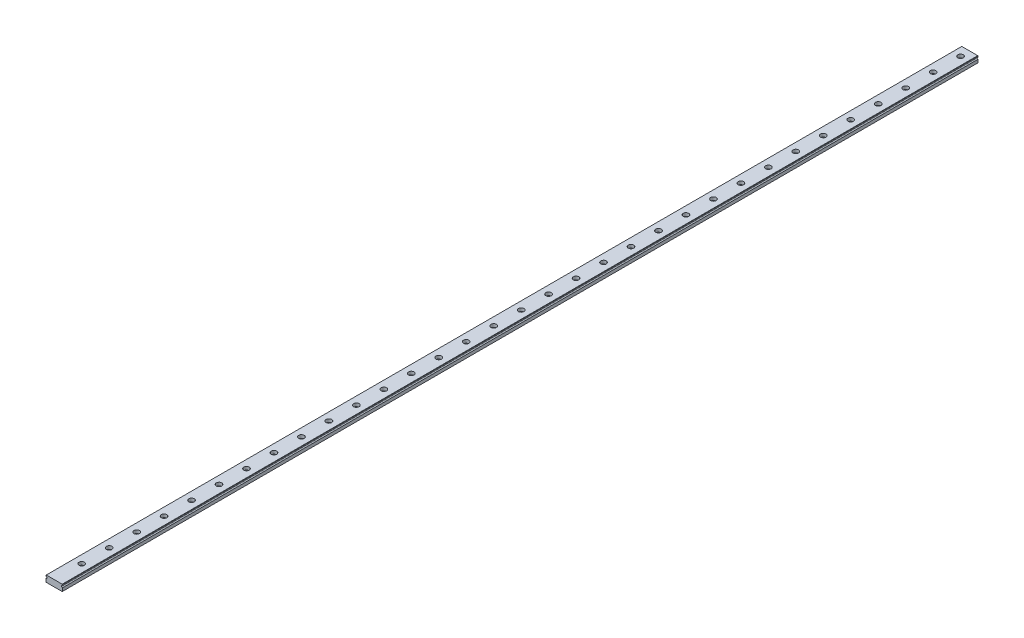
ISO-10303-21;
HEADER;
FILE_DESCRIPTION(('STEP AP214'),'2;1');
FILE_NAME('part.step','',(''),(''),'','','');
FILE_SCHEMA(('AUTOMOTIVE_DESIGN { 1 0 10303 214 1 1 1 1 }'));
ENDSEC;
DATA;
#1=APPLICATION_CONTEXT('core data for automotive mechanical design processes');
#2=APPLICATION_PROTOCOL_DEFINITION('international standard','automotive_design',2000,#1);
#3=PRODUCT_CONTEXT('',#1,'mechanical');
#4=PRODUCT('Part','Part','',(#3));
#5=PRODUCT_RELATED_PRODUCT_CATEGORY('part','',(#4));
#6=PRODUCT_DEFINITION_FORMATION('','',#4);
#7=PRODUCT_DEFINITION_CONTEXT('part definition',#1,'design');
#8=PRODUCT_DEFINITION('design','',#6,#7);
#9=PRODUCT_DEFINITION_SHAPE('','',#8);
#10=(LENGTH_UNIT() NAMED_UNIT(*) SI_UNIT(.MILLI.,.METRE.));
#11=(NAMED_UNIT(*) PLANE_ANGLE_UNIT() SI_UNIT($,.RADIAN.));
#12=(NAMED_UNIT(*) SI_UNIT($,.STERADIAN.) SOLID_ANGLE_UNIT());
#13=UNCERTAINTY_MEASURE_WITH_UNIT(LENGTH_MEASURE(1.E-05),#10,'distance_accuracy_value','');
#14=(GEOMETRIC_REPRESENTATION_CONTEXT(3) GLOBAL_UNCERTAINTY_ASSIGNED_CONTEXT((#13)) GLOBAL_UNIT_ASSIGNED_CONTEXT((#10,
#11,#12)) REPRESENTATION_CONTEXT('',''));
#15=CARTESIAN_POINT('',(0.,0.,0.));
#16=DIRECTION('',(0.,0.,1.));
#17=DIRECTION('',(1.,0.,0.));
#18=AXIS2_PLACEMENT_3D('',#15,#16,#17);
#19=CARTESIAN_POINT('',(8.96453100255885,3.62722971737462,1000.));
#20=DIRECTION('',(0.,-1.,0.));
#21=DIRECTION('',(0.,0.,-1.));
#22=AXIS2_PLACEMENT_3D('',#19,#20,#21);
#23=PLANE('',#22);
#24=CARTESIAN_POINT('',(0.264531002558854,3.62722971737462,129.999999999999));
#25=DIRECTION('',(0.,1.,0.));
#26=DIRECTION('',(0.,0.,1.));
#27=AXIS2_PLACEMENT_3D('',#24,#25,#26);
#28=CIRCLE('',#27,3.);
#29=CARTESIAN_POINT('',(0.264531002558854,3.62722971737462,132.999999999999));
#30=VERTEX_POINT('',#29);
#31=EDGE_CURVE('E773',#30,#30,#28,.T.);
#32=ORIENTED_EDGE('',*,*,#31,.F.);
#33=EDGE_LOOP('',(#32));
#34=FACE_BOUND('',#33,.T.);
#35=CARTESIAN_POINT('',(0.264531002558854,3.62722971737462,159.999999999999));
#36=DIRECTION('',(0.,1.,0.));
#37=DIRECTION('',(0.,0.,1.));
#38=AXIS2_PLACEMENT_3D('',#35,#36,#37);
#39=CIRCLE('',#38,3.);
#40=CARTESIAN_POINT('',(0.264531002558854,3.62722971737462,162.999999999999));
#41=VERTEX_POINT('',#40);
#42=EDGE_CURVE('E757',#41,#41,#39,.T.);
#43=ORIENTED_EDGE('',*,*,#42,.F.);
#44=EDGE_LOOP('',(#43));
#45=FACE_BOUND('',#44,.T.);
#46=CARTESIAN_POINT('',(0.264531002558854,3.62722971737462,219.999999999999));
#47=DIRECTION('',(0.,1.,0.));
#48=DIRECTION('',(0.,0.,1.));
#49=AXIS2_PLACEMENT_3D('',#46,#47,#48);
#50=CIRCLE('',#49,3.);
#51=CARTESIAN_POINT('',(0.264531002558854,3.62722971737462,222.999999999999));
#52=VERTEX_POINT('',#51);
#53=EDGE_CURVE('E725',#52,#52,#50,.T.);
#54=ORIENTED_EDGE('',*,*,#53,.F.);
#55=EDGE_LOOP('',(#54));
#56=FACE_BOUND('',#55,.T.);
#57=CARTESIAN_POINT('',(0.264531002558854,3.62722971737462,249.999999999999));
#58=DIRECTION('',(0.,1.,0.));
#59=DIRECTION('',(0.,0.,1.));
#60=AXIS2_PLACEMENT_3D('',#57,#58,#59);
#61=CIRCLE('',#60,3.);
#62=CARTESIAN_POINT('',(0.264531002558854,3.62722971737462,252.999999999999));
#63=VERTEX_POINT('',#62);
#64=EDGE_CURVE('E709',#63,#63,#61,.T.);
#65=ORIENTED_EDGE('',*,*,#64,.F.);
#66=EDGE_LOOP('',(#65));
#67=FACE_BOUND('',#66,.T.);
#68=CARTESIAN_POINT('',(0.264531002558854,3.62722971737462,279.999999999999));
#69=DIRECTION('',(0.,1.,0.));
#70=DIRECTION('',(0.,0.,1.));
#71=AXIS2_PLACEMENT_3D('',#68,#69,#70);
#72=CIRCLE('',#71,3.);
#73=CARTESIAN_POINT('',(0.264531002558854,3.62722971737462,282.999999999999));
#74=VERTEX_POINT('',#73);
#75=EDGE_CURVE('E693',#74,#74,#72,.T.);
#76=ORIENTED_EDGE('',*,*,#75,.F.);
#77=EDGE_LOOP('',(#76));
#78=FACE_BOUND('',#77,.T.);
#79=CARTESIAN_POINT('',(0.264531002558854,3.62722971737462,399.999999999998));
#80=DIRECTION('',(0.,1.,0.));
#81=DIRECTION('',(0.,0.,1.));
#82=AXIS2_PLACEMENT_3D('',#79,#80,#81);
#83=CIRCLE('',#82,3.);
#84=CARTESIAN_POINT('',(0.264531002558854,3.62722971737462,402.999999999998));
#85=VERTEX_POINT('',#84);
#86=EDGE_CURVE('E629',#85,#85,#83,.T.);
#87=ORIENTED_EDGE('',*,*,#86,.F.);
#88=EDGE_LOOP('',(#87));
#89=FACE_BOUND('',#88,.T.);
#90=CARTESIAN_POINT('',(0.264531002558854,3.62722971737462,429.999999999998));
#91=DIRECTION('',(0.,1.,0.));
#92=DIRECTION('',(0.,0.,1.));
#93=AXIS2_PLACEMENT_3D('',#90,#91,#92);
#94=CIRCLE('',#93,3.);
#95=CARTESIAN_POINT('',(0.264531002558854,3.62722971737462,432.999999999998));
#96=VERTEX_POINT('',#95);
#97=EDGE_CURVE('E613',#96,#96,#94,.T.);
#98=ORIENTED_EDGE('',*,*,#97,.F.);
#99=EDGE_LOOP('',(#98));
#100=FACE_BOUND('',#99,.T.);
#101=CARTESIAN_POINT('',(0.264531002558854,3.62722971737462,489.999999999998));
#102=DIRECTION('',(0.,1.,0.));
#103=DIRECTION('',(0.,0.,1.));
#104=AXIS2_PLACEMENT_3D('',#101,#102,#103);
#105=CIRCLE('',#104,3.);
#106=CARTESIAN_POINT('',(0.264531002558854,3.62722971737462,492.999999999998));
#107=VERTEX_POINT('',#106);
#108=EDGE_CURVE('E581',#107,#107,#105,.T.);
#109=ORIENTED_EDGE('',*,*,#108,.F.);
#110=EDGE_LOOP('',(#109));
#111=FACE_BOUND('',#110,.T.);
#112=CARTESIAN_POINT('',(0.264531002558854,3.62722971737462,519.999999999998));
#113=DIRECTION('',(0.,1.,0.));
#114=DIRECTION('',(0.,0.,1.));
#115=AXIS2_PLACEMENT_3D('',#112,#113,#114);
#116=CIRCLE('',#115,3.);
#117=CARTESIAN_POINT('',(0.264531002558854,3.62722971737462,522.999999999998));
#118=VERTEX_POINT('',#117);
#119=EDGE_CURVE('E565',#118,#118,#116,.T.);
#120=ORIENTED_EDGE('',*,*,#119,.F.);
#121=EDGE_LOOP('',(#120));
#122=FACE_BOUND('',#121,.T.);
#123=CARTESIAN_POINT('',(0.264531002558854,3.62722971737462,549.999999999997));
#124=DIRECTION('',(0.,1.,0.));
#125=DIRECTION('',(0.,0.,1.));
#126=AXIS2_PLACEMENT_3D('',#123,#124,#125);
#127=CIRCLE('',#126,3.);
#128=CARTESIAN_POINT('',(0.264531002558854,3.62722971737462,552.999999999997));
#129=VERTEX_POINT('',#128);
#130=EDGE_CURVE('E549',#129,#129,#127,.T.);
#131=ORIENTED_EDGE('',*,*,#130,.F.);
#132=EDGE_LOOP('',(#131));
#133=FACE_BOUND('',#132,.T.);
#134=CARTESIAN_POINT('',(0.264531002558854,3.62722971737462,579.999999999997));
#135=DIRECTION('',(0.,1.,0.));
#136=DIRECTION('',(0.,0.,1.));
#137=AXIS2_PLACEMENT_3D('',#134,#135,#136);
#138=CIRCLE('',#137,3.);
#139=CARTESIAN_POINT('',(0.264531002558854,3.62722971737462,582.999999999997));
#140=VERTEX_POINT('',#139);
#141=EDGE_CURVE('E533',#140,#140,#138,.T.);
#142=ORIENTED_EDGE('',*,*,#141,.F.);
#143=EDGE_LOOP('',(#142));
#144=FACE_BOUND('',#143,.T.);
#145=CARTESIAN_POINT('',(0.264531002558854,3.62722971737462,609.999999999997));
#146=DIRECTION('',(0.,1.,0.));
#147=DIRECTION('',(0.,0.,1.));
#148=AXIS2_PLACEMENT_3D('',#145,#146,#147);
#149=CIRCLE('',#148,3.);
#150=CARTESIAN_POINT('',(0.264531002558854,3.62722971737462,612.999999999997));
#151=VERTEX_POINT('',#150);
#152=EDGE_CURVE('E517',#151,#151,#149,.T.);
#153=ORIENTED_EDGE('',*,*,#152,.F.);
#154=EDGE_LOOP('',(#153));
#155=FACE_BOUND('',#154,.T.);
#156=CARTESIAN_POINT('',(0.264531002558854,3.62722971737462,699.999999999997));
#157=DIRECTION('',(0.,1.,0.));
#158=DIRECTION('',(0.,0.,1.));
#159=AXIS2_PLACEMENT_3D('',#156,#157,#158);
#160=CIRCLE('',#159,3.);
#161=CARTESIAN_POINT('',(0.264531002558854,3.62722971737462,702.999999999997));
#162=VERTEX_POINT('',#161);
#163=EDGE_CURVE('E469',#162,#162,#160,.T.);
#164=ORIENTED_EDGE('',*,*,#163,.F.);
#165=EDGE_LOOP('',(#164));
#166=FACE_BOUND('',#165,.T.);
#167=CARTESIAN_POINT('',(0.264531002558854,3.62722971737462,729.999999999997));
#168=DIRECTION('',(0.,1.,0.));
#169=DIRECTION('',(0.,0.,1.));
#170=AXIS2_PLACEMENT_3D('',#167,#168,#169);
#171=CIRCLE('',#170,3.);
#172=CARTESIAN_POINT('',(0.264531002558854,3.62722971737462,732.999999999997));
#173=VERTEX_POINT('',#172);
#174=EDGE_CURVE('E453',#173,#173,#171,.T.);
#175=ORIENTED_EDGE('',*,*,#174,.F.);
#176=EDGE_LOOP('',(#175));
#177=FACE_BOUND('',#176,.T.);
#178=CARTESIAN_POINT('',(0.264531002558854,3.62722971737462,759.999999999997));
#179=DIRECTION('',(0.,1.,0.));
#180=DIRECTION('',(0.,0.,1.));
#181=AXIS2_PLACEMENT_3D('',#178,#179,#180);
#182=CIRCLE('',#181,3.);
#183=CARTESIAN_POINT('',(0.264531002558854,3.62722971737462,762.999999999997));
#184=VERTEX_POINT('',#183);
#185=EDGE_CURVE('E437',#184,#184,#182,.T.);
#186=ORIENTED_EDGE('',*,*,#185,.F.);
#187=EDGE_LOOP('',(#186));
#188=FACE_BOUND('',#187,.T.);
#189=CARTESIAN_POINT('',(0.264531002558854,3.62722971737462,789.999999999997));
#190=DIRECTION('',(0.,1.,0.));
#191=DIRECTION('',(0.,0.,1.));
#192=AXIS2_PLACEMENT_3D('',#189,#190,#191);
#193=CIRCLE('',#192,3.);
#194=CARTESIAN_POINT('',(0.264531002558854,3.62722971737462,792.999999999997));
#195=VERTEX_POINT('',#194);
#196=EDGE_CURVE('E421',#195,#195,#193,.T.);
#197=ORIENTED_EDGE('',*,*,#196,.F.);
#198=EDGE_LOOP('',(#197));
#199=FACE_BOUND('',#198,.T.);
#200=CARTESIAN_POINT('',(0.264531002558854,3.62722971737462,819.999999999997));
#201=DIRECTION('',(0.,1.,0.));
#202=DIRECTION('',(0.,0.,1.));
#203=AXIS2_PLACEMENT_3D('',#200,#201,#202);
#204=CIRCLE('',#203,3.);
#205=CARTESIAN_POINT('',(0.264531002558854,3.62722971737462,822.999999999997));
#206=VERTEX_POINT('',#205);
#207=EDGE_CURVE('E405',#206,#206,#204,.T.);
#208=ORIENTED_EDGE('',*,*,#207,.F.);
#209=EDGE_LOOP('',(#208));
#210=FACE_BOUND('',#209,.T.);
#211=CARTESIAN_POINT('',(0.264531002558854,3.62722971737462,849.999999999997));
#212=DIRECTION('',(0.,1.,0.));
#213=DIRECTION('',(0.,0.,1.));
#214=AXIS2_PLACEMENT_3D('',#211,#212,#213);
#215=CIRCLE('',#214,3.);
#216=CARTESIAN_POINT('',(0.264531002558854,3.62722971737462,852.999999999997));
#217=VERTEX_POINT('',#216);
#218=EDGE_CURVE('E389',#217,#217,#215,.T.);
#219=ORIENTED_EDGE('',*,*,#218,.F.);
#220=EDGE_LOOP('',(#219));
#221=FACE_BOUND('',#220,.T.);
#222=CARTESIAN_POINT('',(0.264531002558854,3.62722971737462,879.999999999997));
#223=DIRECTION('',(0.,1.,0.));
#224=DIRECTION('',(0.,0.,1.));
#225=AXIS2_PLACEMENT_3D('',#222,#223,#224);
#226=CIRCLE('',#225,3.);
#227=CARTESIAN_POINT('',(0.264531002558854,3.62722971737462,882.999999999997));
#228=VERTEX_POINT('',#227);
#229=EDGE_CURVE('E373',#228,#228,#226,.T.);
#230=ORIENTED_EDGE('',*,*,#229,.F.);
#231=EDGE_LOOP('',(#230));
#232=FACE_BOUND('',#231,.T.);
#233=CARTESIAN_POINT('',(0.264531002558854,3.62722971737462,909.999999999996));
#234=DIRECTION('',(0.,1.,0.));
#235=DIRECTION('',(0.,0.,1.));
#236=AXIS2_PLACEMENT_3D('',#233,#234,#235);
#237=CIRCLE('',#236,3.);
#238=CARTESIAN_POINT('',(0.264531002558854,3.62722971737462,912.999999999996));
#239=VERTEX_POINT('',#238);
#240=EDGE_CURVE('E357',#239,#239,#237,.T.);
#241=ORIENTED_EDGE('',*,*,#240,.F.);
#242=EDGE_LOOP('',(#241));
#243=FACE_BOUND('',#242,.T.);
#244=CARTESIAN_POINT('',(0.264531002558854,3.62722971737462,939.999999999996));
#245=DIRECTION('',(0.,1.,0.));
#246=DIRECTION('',(0.,0.,1.));
#247=AXIS2_PLACEMENT_3D('',#244,#245,#246);
#248=CIRCLE('',#247,3.);
#249=CARTESIAN_POINT('',(0.264531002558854,3.62722971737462,942.999999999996));
#250=VERTEX_POINT('',#249);
#251=EDGE_CURVE('E341',#250,#250,#248,.T.);
#252=ORIENTED_EDGE('',*,*,#251,.F.);
#253=EDGE_LOOP('',(#252));
#254=FACE_BOUND('',#253,.T.);
#255=CARTESIAN_POINT('',(0.264531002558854,3.62722971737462,969.999999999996));
#256=DIRECTION('',(0.,1.,0.));
#257=DIRECTION('',(0.,0.,1.));
#258=AXIS2_PLACEMENT_3D('',#255,#256,#257);
#259=CIRCLE('',#258,3.);
#260=CARTESIAN_POINT('',(0.264531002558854,3.62722971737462,972.999999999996));
#261=VERTEX_POINT('',#260);
#262=EDGE_CURVE('E325',#261,#261,#259,.T.);
#263=ORIENTED_EDGE('',*,*,#262,.F.);
#264=EDGE_LOOP('',(#263));
#265=FACE_BOUND('',#264,.T.);
#266=CARTESIAN_POINT('',(0.264531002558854,3.62722971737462,10.));
#267=DIRECTION('',(0.,1.,0.));
#268=DIRECTION('',(0.,0.,1.));
#269=AXIS2_PLACEMENT_3D('',#266,#267,#268);
#270=CIRCLE('',#269,3.);
#271=CARTESIAN_POINT('',(0.264531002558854,3.62722971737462,13.));
#272=VERTEX_POINT('',#271);
#273=EDGE_CURVE('E309',#272,#272,#270,.T.);
#274=ORIENTED_EDGE('',*,*,#273,.F.);
#275=EDGE_LOOP('',(#274));
#276=FACE_BOUND('',#275,.T.);
#277=DIRECTION('',(-1.,0.,0.));
#278=VECTOR('',#277,1.);
#279=CARTESIAN_POINT('',(8.96453100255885,3.62722971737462,0.));
#280=LINE('',#279,#278);
#281=CARTESIAN_POINT('',(8.96453100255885,3.62722971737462,0.));
#282=VERTEX_POINT('',#281);
#283=CARTESIAN_POINT('',(-8.43546899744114,3.62722971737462,0.));
#284=VERTEX_POINT('',#283);
#285=EDGE_CURVE('E181',#282,#284,#280,.T.);
#286=ORIENTED_EDGE('',*,*,#285,.T.);
#287=DIRECTION('',(0.,0.,-1.));
#288=VECTOR('',#287,1.);
#289=CARTESIAN_POINT('',(-8.43546899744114,3.62722971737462,1000.));
#290=LINE('',#289,#288);
#291=CARTESIAN_POINT('',(-8.43546899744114,3.62722971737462,1000.));
#292=VERTEX_POINT('',#291);
#293=EDGE_CURVE('E231',#292,#284,#290,.T.);
#294=ORIENTED_EDGE('',*,*,#293,.F.);
#295=DIRECTION('',(-1.,0.,0.));
#296=VECTOR('',#295,1.);
#297=CARTESIAN_POINT('',(8.96453100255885,3.62722971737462,1000.));
#298=LINE('',#297,#296);
#299=CARTESIAN_POINT('',(8.96453100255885,3.62722971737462,1000.));
#300=VERTEX_POINT('',#299);
#301=EDGE_CURVE('E265',#300,#292,#298,.T.);
#302=ORIENTED_EDGE('',*,*,#301,.F.);
#303=DIRECTION('',(0.,0.,-1.));
#304=VECTOR('',#303,1.);
#305=CARTESIAN_POINT('',(8.96453100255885,3.62722971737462,1000.));
#306=LINE('',#305,#304);
#307=EDGE_CURVE('E235',#300,#282,#306,.T.);
#308=ORIENTED_EDGE('',*,*,#307,.T.);
#309=EDGE_LOOP('',(#286,#294,#302,#308));
#310=FACE_BOUND('',#309,.T.);
#311=CARTESIAN_POINT('',(0.264531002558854,3.62722971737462,669.999999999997));
#312=DIRECTION('',(0.,1.,0.));
#313=DIRECTION('',(0.,0.,1.));
#314=AXIS2_PLACEMENT_3D('',#311,#312,#313);
#315=CIRCLE('',#314,3.);
#316=CARTESIAN_POINT('',(0.264531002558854,3.62722971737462,672.999999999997));
#317=VERTEX_POINT('',#316);
#318=EDGE_CURVE('E485',#317,#317,#315,.T.);
#319=ORIENTED_EDGE('',*,*,#318,.F.);
#320=EDGE_LOOP('',(#319));
#321=FACE_BOUND('',#320,.T.);
#322=CARTESIAN_POINT('',(0.264531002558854,3.62722971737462,639.999999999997));
#323=DIRECTION('',(0.,1.,0.));
#324=DIRECTION('',(0.,0.,1.));
#325=AXIS2_PLACEMENT_3D('',#322,#323,#324);
#326=CIRCLE('',#325,3.);
#327=CARTESIAN_POINT('',(0.264531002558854,3.62722971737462,642.999999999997));
#328=VERTEX_POINT('',#327);
#329=EDGE_CURVE('E501',#328,#328,#326,.T.);
#330=ORIENTED_EDGE('',*,*,#329,.F.);
#331=EDGE_LOOP('',(#330));
#332=FACE_BOUND('',#331,.T.);
#333=CARTESIAN_POINT('',(0.264531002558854,3.62722971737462,459.999999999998));
#334=DIRECTION('',(0.,1.,0.));
#335=DIRECTION('',(0.,0.,1.));
#336=AXIS2_PLACEMENT_3D('',#333,#334,#335);
#337=CIRCLE('',#336,3.);
#338=CARTESIAN_POINT('',(0.264531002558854,3.62722971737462,462.999999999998));
#339=VERTEX_POINT('',#338);
#340=EDGE_CURVE('E597',#339,#339,#337,.T.);
#341=ORIENTED_EDGE('',*,*,#340,.F.);
#342=EDGE_LOOP('',(#341));
#343=FACE_BOUND('',#342,.T.);
#344=CARTESIAN_POINT('',(0.264531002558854,3.62722971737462,369.999999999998));
#345=DIRECTION('',(0.,1.,0.));
#346=DIRECTION('',(0.,0.,1.));
#347=AXIS2_PLACEMENT_3D('',#344,#345,#346);
#348=CIRCLE('',#347,3.);
#349=CARTESIAN_POINT('',(0.264531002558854,3.62722971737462,372.999999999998));
#350=VERTEX_POINT('',#349);
#351=EDGE_CURVE('E645',#350,#350,#348,.T.);
#352=ORIENTED_EDGE('',*,*,#351,.F.);
#353=EDGE_LOOP('',(#352));
#354=FACE_BOUND('',#353,.T.);
#355=CARTESIAN_POINT('',(0.264531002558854,3.62722971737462,339.999999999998));
#356=DIRECTION('',(0.,1.,0.));
#357=DIRECTION('',(0.,0.,1.));
#358=AXIS2_PLACEMENT_3D('',#355,#356,#357);
#359=CIRCLE('',#358,3.);
#360=CARTESIAN_POINT('',(0.264531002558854,3.62722971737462,342.999999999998));
#361=VERTEX_POINT('',#360);
#362=EDGE_CURVE('E661',#361,#361,#359,.T.);
#363=ORIENTED_EDGE('',*,*,#362,.F.);
#364=EDGE_LOOP('',(#363));
#365=FACE_BOUND('',#364,.T.);
#366=CARTESIAN_POINT('',(0.264531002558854,3.62722971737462,309.999999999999));
#367=DIRECTION('',(0.,1.,0.));
#368=DIRECTION('',(0.,0.,1.));
#369=AXIS2_PLACEMENT_3D('',#366,#367,#368);
#370=CIRCLE('',#369,3.);
#371=CARTESIAN_POINT('',(0.264531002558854,3.62722971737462,312.999999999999));
#372=VERTEX_POINT('',#371);
#373=EDGE_CURVE('E677',#372,#372,#370,.T.);
#374=ORIENTED_EDGE('',*,*,#373,.F.);
#375=EDGE_LOOP('',(#374));
#376=FACE_BOUND('',#375,.T.);
#377=CARTESIAN_POINT('',(0.264531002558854,3.62722971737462,189.999999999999));
#378=DIRECTION('',(0.,1.,0.));
#379=DIRECTION('',(0.,0.,1.));
#380=AXIS2_PLACEMENT_3D('',#377,#378,#379);
#381=CIRCLE('',#380,3.);
#382=CARTESIAN_POINT('',(0.264531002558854,3.62722971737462,192.999999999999));
#383=VERTEX_POINT('',#382);
#384=EDGE_CURVE('E741',#383,#383,#381,.T.);
#385=ORIENTED_EDGE('',*,*,#384,.F.);
#386=EDGE_LOOP('',(#385));
#387=FACE_BOUND('',#386,.T.);
#388=CARTESIAN_POINT('',(0.264531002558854,3.62722971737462,99.9999999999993));
#389=DIRECTION('',(0.,1.,0.));
#390=DIRECTION('',(0.,0.,1.));
#391=AXIS2_PLACEMENT_3D('',#388,#389,#390);
#392=CIRCLE('',#391,3.);
#393=CARTESIAN_POINT('',(0.264531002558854,3.62722971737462,102.999999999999));
#394=VERTEX_POINT('',#393);
#395=EDGE_CURVE('E789',#394,#394,#392,.T.);
#396=ORIENTED_EDGE('',*,*,#395,.F.);
#397=EDGE_LOOP('',(#396));
#398=FACE_BOUND('',#397,.T.);
#399=CARTESIAN_POINT('',(0.264531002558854,3.62722971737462,69.9999999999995));
#400=DIRECTION('',(0.,1.,0.));
#401=DIRECTION('',(0.,0.,1.));
#402=AXIS2_PLACEMENT_3D('',#399,#400,#401);
#403=CIRCLE('',#402,3.);
#404=CARTESIAN_POINT('',(0.264531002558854,3.62722971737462,72.9999999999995));
#405=VERTEX_POINT('',#404);
#406=EDGE_CURVE('E805',#405,#405,#403,.T.);
#407=ORIENTED_EDGE('',*,*,#406,.F.);
#408=EDGE_LOOP('',(#407));
#409=FACE_BOUND('',#408,.T.);
#410=CARTESIAN_POINT('',(0.264531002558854,3.62722971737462,39.9999999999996));
#411=DIRECTION('',(0.,1.,0.));
#412=DIRECTION('',(0.,0.,1.));
#413=AXIS2_PLACEMENT_3D('',#410,#411,#412);
#414=CIRCLE('',#413,3.);
#415=CARTESIAN_POINT('',(0.264531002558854,3.62722971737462,42.9999999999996));
#416=VERTEX_POINT('',#415);
#417=EDGE_CURVE('E821',#416,#416,#414,.T.);
#418=ORIENTED_EDGE('',*,*,#417,.F.);
#419=EDGE_LOOP('',(#418));
#420=FACE_BOUND('',#419,.T.);
#421=ADVANCED_FACE('F45',(#34,#45,#56,#67,#78,#89,#100,#111,#122,#133,#144,#155,#166,#177,#188,
#199,#210,#221,#232,#243,#254,#265,#276,#310,#321,#332,#343,#354,#365,#376,#387,#398,#409,#420),
#23,.F.);
#422=CARTESIAN_POINT('',(9.26453100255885,2.32722971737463,1000.));
#423=DIRECTION('',(-1.,0.,0.));
#424=DIRECTION('',(0.,0.,1.));
#425=AXIS2_PLACEMENT_3D('',#422,#423,#424);
#426=PLANE('',#425);
#427=DIRECTION('',(0.,1.,0.));
#428=VECTOR('',#427,1.);
#429=CARTESIAN_POINT('',(9.26453100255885,2.32722971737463,0.));
#430=LINE('',#429,#428);
#431=CARTESIAN_POINT('',(9.26453100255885,2.32722971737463,0.));
#432=VERTEX_POINT('',#431);
#433=CARTESIAN_POINT('',(9.26453100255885,3.32722971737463,0.));
#434=VERTEX_POINT('',#433);
#435=EDGE_CURVE('E174',#432,#434,#430,.T.);
#436=ORIENTED_EDGE('',*,*,#435,.T.);
#437=DIRECTION('',(0.,0.,-1.));
#438=VECTOR('',#437,1.);
#439=CARTESIAN_POINT('',(9.26453100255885,3.32722971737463,1000.));
#440=LINE('',#439,#438);
#441=CARTESIAN_POINT('',(9.26453100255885,3.32722971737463,1000.));
#442=VERTEX_POINT('',#441);
#443=EDGE_CURVE('E55',#442,#434,#440,.T.);
#444=ORIENTED_EDGE('',*,*,#443,.F.);
#445=DIRECTION('',(0.,1.,0.));
#446=VECTOR('',#445,1.);
#447=CARTESIAN_POINT('',(9.26453100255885,2.32722971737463,1000.));
#448=LINE('',#447,#446);
#449=CARTESIAN_POINT('',(9.26453100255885,2.32722971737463,1000.));
#450=VERTEX_POINT('',#449);
#451=EDGE_CURVE('E119',#450,#442,#448,.T.);
#452=ORIENTED_EDGE('',*,*,#451,.F.);
#453=DIRECTION('',(0.,0.,-1.));
#454=VECTOR('',#453,1.);
#455=CARTESIAN_POINT('',(9.26453100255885,2.32722971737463,1000.));
#456=LINE('',#455,#454);
#457=EDGE_CURVE('E12',#450,#432,#456,.T.);
#458=ORIENTED_EDGE('',*,*,#457,.T.);
#459=EDGE_LOOP('',(#436,#444,#452,#458));
#460=FACE_BOUND('',#459,.T.);
#461=ADVANCED_FACE('F47',(#460),#426,.F.);
#462=CARTESIAN_POINT('',(9.26453100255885,3.32722971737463,1000.));
#463=DIRECTION('',(-0.707106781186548,-0.707106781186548,0.));
#464=DIRECTION('',(0.707106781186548,-0.707106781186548,0.));
#465=AXIS2_PLACEMENT_3D('',#462,#463,#464);
#466=PLANE('',#465);
#467=DIRECTION('',(-0.707106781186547,0.707106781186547,0.));
#468=VECTOR('',#467,1.);
#469=CARTESIAN_POINT('',(9.26453100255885,3.32722971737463,0.));
#470=LINE('',#469,#468);
#471=EDGE_CURVE('E177',#434,#282,#470,.T.);
#472=ORIENTED_EDGE('',*,*,#471,.T.);
#473=ORIENTED_EDGE('',*,*,#307,.F.);
#474=DIRECTION('',(-0.707106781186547,0.707106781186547,0.));
#475=VECTOR('',#474,1.);
#476=CARTESIAN_POINT('',(9.26453100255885,3.32722971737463,1000.));
#477=LINE('',#476,#475);
#478=EDGE_CURVE('E245',#442,#300,#477,.T.);
#479=ORIENTED_EDGE('',*,*,#478,.F.);
#480=ORIENTED_EDGE('',*,*,#443,.T.);
#481=EDGE_LOOP('',(#472,#473,#479,#480));
#482=FACE_BOUND('',#481,.T.);
#483=ADVANCED_FACE('F243',(#482),#466,.F.);
#484=CARTESIAN_POINT('',(-8.43546899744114,3.62722971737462,1000.));
#485=DIRECTION('',(0.707106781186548,-0.707106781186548,0.));
#486=DIRECTION('',(0.707106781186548,0.707106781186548,0.));
#487=AXIS2_PLACEMENT_3D('',#484,#485,#486);
#488=PLANE('',#487);
#489=DIRECTION('',(-0.707106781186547,-0.707106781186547,0.));
#490=VECTOR('',#489,1.);
#491=CARTESIAN_POINT('',(-8.43546899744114,3.62722971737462,0.));
#492=LINE('',#491,#490);
#493=CARTESIAN_POINT('',(-8.73546899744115,3.32722971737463,0.));
#494=VERTEX_POINT('',#493);
#495=EDGE_CURVE('E184',#284,#494,#492,.T.);
#496=ORIENTED_EDGE('',*,*,#495,.T.);
#497=DIRECTION('',(0.,0.,-1.));
#498=VECTOR('',#497,1.);
#499=CARTESIAN_POINT('',(-8.73546899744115,3.32722971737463,1000.));
#500=LINE('',#499,#498);
#501=CARTESIAN_POINT('',(-8.73546899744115,3.32722971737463,1000.));
#502=VERTEX_POINT('',#501);
#503=EDGE_CURVE('E227',#502,#494,#500,.T.);
#504=ORIENTED_EDGE('',*,*,#503,.F.);
#505=DIRECTION('',(-0.707106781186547,-0.707106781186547,0.));
#506=VECTOR('',#505,1.);
#507=CARTESIAN_POINT('',(-8.43546899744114,3.62722971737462,1000.));
#508=LINE('',#507,#506);
#509=EDGE_CURVE('E261',#292,#502,#508,.T.);
#510=ORIENTED_EDGE('',*,*,#509,.F.);
#511=ORIENTED_EDGE('',*,*,#293,.T.);
#512=EDGE_LOOP('',(#496,#504,#510,#511));
#513=FACE_BOUND('',#512,.T.);
#514=ADVANCED_FACE('F259',(#513),#488,.F.);
#515=CARTESIAN_POINT('',(-8.73546899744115,3.32722971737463,1000.));
#516=DIRECTION('',(1.,0.,0.));
#517=DIRECTION('',(0.,0.,-1.));
#518=AXIS2_PLACEMENT_3D('',#515,#516,#517);
#519=PLANE('',#518);
#520=DIRECTION('',(0.,-1.,0.));
#521=VECTOR('',#520,1.);
#522=CARTESIAN_POINT('',(-8.73546899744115,3.32722971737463,0.));
#523=LINE('',#522,#521);
#524=CARTESIAN_POINT('',(-8.73546899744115,2.32722971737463,0.));
#525=VERTEX_POINT('',#524);
#526=EDGE_CURVE('E187',#494,#525,#523,.T.);
#527=ORIENTED_EDGE('',*,*,#526,.T.);
#528=DIRECTION('',(0.,0.,-1.));
#529=VECTOR('',#528,1.);
#530=CARTESIAN_POINT('',(-8.73546899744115,2.32722971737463,1000.));
#531=LINE('',#530,#529);
#532=CARTESIAN_POINT('',(-8.73546899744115,2.32722971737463,1000.));
#533=VERTEX_POINT('',#532);
#534=EDGE_CURVE('E223',#533,#525,#531,.T.);
#535=ORIENTED_EDGE('',*,*,#534,.F.);
#536=DIRECTION('',(0.,-1.,0.));
#537=VECTOR('',#536,1.);
#538=CARTESIAN_POINT('',(-8.73546899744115,3.32722971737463,1000.));
#539=LINE('',#538,#537);
#540=EDGE_CURVE('E264',#502,#533,#539,.T.);
#541=ORIENTED_EDGE('',*,*,#540,.F.);
#542=ORIENTED_EDGE('',*,*,#503,.T.);
#543=EDGE_LOOP('',(#527,#535,#541,#542));
#544=FACE_BOUND('',#543,.T.);
#545=ADVANCED_FACE('F842',(#544),#519,.F.);
#546=CARTESIAN_POINT('',(-8.73546899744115,1.32722971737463,1000.));
#547=DIRECTION('',(0.,0.,-1.));
#548=DIRECTION('',(-1.,0.,0.));
#549=AXIS2_PLACEMENT_3D('',#546,#547,#548);
#550=CYLINDRICAL_SURFACE('',#549,1.);
#551=CARTESIAN_POINT('',(-8.73546899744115,1.32722971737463,0.));
#552=DIRECTION('',(0.,0.,-1.));
#553=DIRECTION('',(1.,0.,0.));
#554=AXIS2_PLACEMENT_3D('',#551,#552,#553);
#555=CIRCLE('',#554,1.);
#556=CARTESIAN_POINT('',(-8.73546899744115,0.327229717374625,0.));
#557=VERTEX_POINT('',#556);
#558=EDGE_CURVE('E190',#525,#557,#555,.T.);
#559=ORIENTED_EDGE('',*,*,#558,.T.);
#560=DIRECTION('',(0.,0.,-1.));
#561=VECTOR('',#560,1.);
#562=CARTESIAN_POINT('',(-8.73546899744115,0.327229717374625,1000.));
#563=LINE('',#562,#561);
#564=CARTESIAN_POINT('',(-8.73546899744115,0.327229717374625,1000.));
#565=VERTEX_POINT('',#564);
#566=EDGE_CURVE('E219',#565,#557,#563,.T.);
#567=ORIENTED_EDGE('',*,*,#566,.F.);
#568=CARTESIAN_POINT('',(-8.73546899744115,1.32722971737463,1000.));
#569=DIRECTION('',(0.,0.,-1.));
#570=DIRECTION('',(1.,0.,0.));
#571=AXIS2_PLACEMENT_3D('',#568,#569,#570);
#572=CIRCLE('',#571,1.);
#573=EDGE_CURVE('E269',#533,#565,#572,.T.);
#574=ORIENTED_EDGE('',*,*,#573,.F.);
#575=ORIENTED_EDGE('',*,*,#534,.T.);
#576=EDGE_LOOP('',(#559,#567,#574,#575));
#577=FACE_BOUND('',#576,.T.);
#578=ADVANCED_FACE('F846',(#577),#550,.F.);
#579=CARTESIAN_POINT('',(-8.73546899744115,0.327229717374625,1000.));
#580=DIRECTION('',(1.,0.,0.));
#581=DIRECTION('',(0.,0.,-1.));
#582=AXIS2_PLACEMENT_3D('',#579,#580,#581);
#583=PLANE('',#582);
#584=DIRECTION('',(0.,-1.,0.));
#585=VECTOR('',#584,1.);
#586=CARTESIAN_POINT('',(-8.73546899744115,0.327229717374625,0.));
#587=LINE('',#586,#585);
#588=CARTESIAN_POINT('',(-8.73546899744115,-3.07277028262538,0.));
#589=VERTEX_POINT('',#588);
#590=EDGE_CURVE('E193',#557,#589,#587,.T.);
#591=ORIENTED_EDGE('',*,*,#590,.T.);
#592=DIRECTION('',(0.,0.,-1.));
#593=VECTOR('',#592,1.);
#594=CARTESIAN_POINT('',(-8.73546899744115,-3.07277028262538,1000.));
#595=LINE('',#594,#593);
#596=CARTESIAN_POINT('',(-8.73546899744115,-3.07277028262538,1000.));
#597=VERTEX_POINT('',#596);
#598=EDGE_CURVE('E215',#597,#589,#595,.T.);
#599=ORIENTED_EDGE('',*,*,#598,.F.);
#600=DIRECTION('',(0.,-1.,0.));
#601=VECTOR('',#600,1.);
#602=CARTESIAN_POINT('',(-8.73546899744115,0.327229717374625,1000.));
#603=LINE('',#602,#601);
#604=EDGE_CURVE('E276',#565,#597,#603,.T.);
#605=ORIENTED_EDGE('',*,*,#604,.F.);
#606=ORIENTED_EDGE('',*,*,#566,.T.);
#607=EDGE_LOOP('',(#591,#599,#605,#606));
#608=FACE_BOUND('',#607,.T.);
#609=ADVANCED_FACE('F284',(#608),#583,.F.);
#610=CARTESIAN_POINT('',(-8.73546899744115,-3.07277028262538,1000.));
#611=DIRECTION('',(0.707106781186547,0.707106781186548,0.));
#612=DIRECTION('',(-0.707106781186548,0.707106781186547,0.));
#613=AXIS2_PLACEMENT_3D('',#610,#611,#612);
#614=PLANE('',#613);
#615=DIRECTION('',(0.707106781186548,-0.707106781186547,0.));
#616=VECTOR('',#615,1.);
#617=CARTESIAN_POINT('',(-8.73546899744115,-3.07277028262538,0.));
#618=LINE('',#617,#616);
#619=CARTESIAN_POINT('',(-8.43546899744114,-3.37277028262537,0.));
#620=VERTEX_POINT('',#619);
#621=EDGE_CURVE('E196',#589,#620,#618,.T.);
#622=ORIENTED_EDGE('',*,*,#621,.T.);
#623=DIRECTION('',(0.,0.,-1.));
#624=VECTOR('',#623,1.);
#625=CARTESIAN_POINT('',(-8.43546899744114,-3.37277028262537,1000.));
#626=LINE('',#625,#624);
#627=CARTESIAN_POINT('',(-8.43546899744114,-3.37277028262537,1000.));
#628=VERTEX_POINT('',#627);
#629=EDGE_CURVE('E161',#628,#620,#626,.T.);
#630=ORIENTED_EDGE('',*,*,#629,.F.);
#631=DIRECTION('',(0.707106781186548,-0.707106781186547,0.));
#632=VECTOR('',#631,1.);
#633=CARTESIAN_POINT('',(-8.73546899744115,-3.07277028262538,1000.));
#634=LINE('',#633,#632);
#635=EDGE_CURVE('E151',#597,#628,#634,.T.);
#636=ORIENTED_EDGE('',*,*,#635,.F.);
#637=ORIENTED_EDGE('',*,*,#598,.T.);
#638=EDGE_LOOP('',(#622,#630,#636,#637));
#639=FACE_BOUND('',#638,.T.);
#640=ADVANCED_FACE('F288',(#639),#614,.F.);
#641=CARTESIAN_POINT('',(5.06453100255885,-3.37277028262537,1000.));
#642=DIRECTION('',(0.,1.,0.));
#643=DIRECTION('',(-1.,0.,0.));
#644=AXIS2_PLACEMENT_3D('',#641,#642,#643);
#645=PLANE('',#644);
#646=CARTESIAN_POINT('',(0.264531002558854,-3.37277028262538,39.9999999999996));
#647=DIRECTION('',(0.,1.,0.));
#648=DIRECTION('',(0.,0.,1.));
#649=AXIS2_PLACEMENT_3D('',#646,#647,#648);
#650=CIRCLE('',#649,1.75);
#651=CARTESIAN_POINT('',(0.264531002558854,-3.37277028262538,41.7499999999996));
#652=VERTEX_POINT('',#651);
#653=EDGE_CURVE('E809',#652,#652,#650,.T.);
#654=ORIENTED_EDGE('',*,*,#653,.T.);
#655=EDGE_LOOP('',(#654));
#656=FACE_BOUND('',#655,.T.);
#657=CARTESIAN_POINT('',(0.264531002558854,-3.37277028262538,69.9999999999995));
#658=DIRECTION('',(0.,1.,0.));
#659=DIRECTION('',(0.,0.,1.));
#660=AXIS2_PLACEMENT_3D('',#657,#658,#659);
#661=CIRCLE('',#660,1.75);
#662=CARTESIAN_POINT('',(0.264531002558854,-3.37277028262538,71.7499999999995));
#663=VERTEX_POINT('',#662);
#664=EDGE_CURVE('E793',#663,#663,#661,.T.);
#665=ORIENTED_EDGE('',*,*,#664,.T.);
#666=EDGE_LOOP('',(#665));
#667=FACE_BOUND('',#666,.T.);
#668=CARTESIAN_POINT('',(0.264531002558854,-3.37277028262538,99.9999999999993));
#669=DIRECTION('',(0.,1.,0.));
#670=DIRECTION('',(0.,0.,1.));
#671=AXIS2_PLACEMENT_3D('',#668,#669,#670);
#672=CIRCLE('',#671,1.75);
#673=CARTESIAN_POINT('',(0.264531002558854,-3.37277028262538,101.749999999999));
#674=VERTEX_POINT('',#673);
#675=EDGE_CURVE('E777',#674,#674,#672,.T.);
#676=ORIENTED_EDGE('',*,*,#675,.T.);
#677=EDGE_LOOP('',(#676));
#678=FACE_BOUND('',#677,.T.);
#679=CARTESIAN_POINT('',(0.264531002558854,-3.37277028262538,129.999999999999));
#680=DIRECTION('',(0.,1.,0.));
#681=DIRECTION('',(0.,0.,1.));
#682=AXIS2_PLACEMENT_3D('',#679,#680,#681);
#683=CIRCLE('',#682,1.75);
#684=CARTESIAN_POINT('',(0.264531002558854,-3.37277028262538,131.749999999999));
#685=VERTEX_POINT('',#684);
#686=EDGE_CURVE('E761',#685,#685,#683,.T.);
#687=ORIENTED_EDGE('',*,*,#686,.T.);
#688=EDGE_LOOP('',(#687));
#689=FACE_BOUND('',#688,.T.);
#690=CARTESIAN_POINT('',(0.264531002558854,-3.37277028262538,159.999999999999));
#691=DIRECTION('',(0.,1.,0.));
#692=DIRECTION('',(0.,0.,1.));
#693=AXIS2_PLACEMENT_3D('',#690,#691,#692);
#694=CIRCLE('',#693,1.75);
#695=CARTESIAN_POINT('',(0.264531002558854,-3.37277028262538,161.749999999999));
#696=VERTEX_POINT('',#695);
#697=EDGE_CURVE('E745',#696,#696,#694,.T.);
#698=ORIENTED_EDGE('',*,*,#697,.T.);
#699=EDGE_LOOP('',(#698));
#700=FACE_BOUND('',#699,.T.);
#701=CARTESIAN_POINT('',(0.264531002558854,-3.37277028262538,189.999999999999));
#702=DIRECTION('',(0.,1.,0.));
#703=DIRECTION('',(0.,0.,1.));
#704=AXIS2_PLACEMENT_3D('',#701,#702,#703);
#705=CIRCLE('',#704,1.75);
#706=CARTESIAN_POINT('',(0.264531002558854,-3.37277028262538,191.749999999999));
#707=VERTEX_POINT('',#706);
#708=EDGE_CURVE('E729',#707,#707,#705,.T.);
#709=ORIENTED_EDGE('',*,*,#708,.T.);
#710=EDGE_LOOP('',(#709));
#711=FACE_BOUND('',#710,.T.);
#712=CARTESIAN_POINT('',(0.264531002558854,-3.37277028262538,219.999999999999));
#713=DIRECTION('',(0.,1.,0.));
#714=DIRECTION('',(0.,0.,1.));
#715=AXIS2_PLACEMENT_3D('',#712,#713,#714);
#716=CIRCLE('',#715,1.75);
#717=CARTESIAN_POINT('',(0.264531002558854,-3.37277028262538,221.749999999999));
#718=VERTEX_POINT('',#717);
#719=EDGE_CURVE('E713',#718,#718,#716,.T.);
#720=ORIENTED_EDGE('',*,*,#719,.T.);
#721=EDGE_LOOP('',(#720));
#722=FACE_BOUND('',#721,.T.);
#723=CARTESIAN_POINT('',(0.264531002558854,-3.37277028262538,249.999999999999));
#724=DIRECTION('',(0.,1.,0.));
#725=DIRECTION('',(0.,0.,1.));
#726=AXIS2_PLACEMENT_3D('',#723,#724,#725);
#727=CIRCLE('',#726,1.75);
#728=CARTESIAN_POINT('',(0.264531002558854,-3.37277028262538,251.749999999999));
#729=VERTEX_POINT('',#728);
#730=EDGE_CURVE('E697',#729,#729,#727,.T.);
#731=ORIENTED_EDGE('',*,*,#730,.T.);
#732=EDGE_LOOP('',(#731));
#733=FACE_BOUND('',#732,.T.);
#734=CARTESIAN_POINT('',(0.264531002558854,-3.37277028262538,279.999999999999));
#735=DIRECTION('',(0.,1.,0.));
#736=DIRECTION('',(0.,0.,1.));
#737=AXIS2_PLACEMENT_3D('',#734,#735,#736);
#738=CIRCLE('',#737,1.75);
#739=CARTESIAN_POINT('',(0.264531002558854,-3.37277028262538,281.749999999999));
#740=VERTEX_POINT('',#739);
#741=EDGE_CURVE('E681',#740,#740,#738,.T.);
#742=ORIENTED_EDGE('',*,*,#741,.T.);
#743=EDGE_LOOP('',(#742));
#744=FACE_BOUND('',#743,.T.);
#745=CARTESIAN_POINT('',(0.264531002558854,-3.37277028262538,309.999999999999));
#746=DIRECTION('',(0.,1.,0.));
#747=DIRECTION('',(0.,0.,1.));
#748=AXIS2_PLACEMENT_3D('',#745,#746,#747);
#749=CIRCLE('',#748,1.75);
#750=CARTESIAN_POINT('',(0.264531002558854,-3.37277028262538,311.749999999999));
#751=VERTEX_POINT('',#750);
#752=EDGE_CURVE('E665',#751,#751,#749,.T.);
#753=ORIENTED_EDGE('',*,*,#752,.T.);
#754=EDGE_LOOP('',(#753));
#755=FACE_BOUND('',#754,.T.);
#756=CARTESIAN_POINT('',(0.264531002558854,-3.37277028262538,339.999999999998));
#757=DIRECTION('',(0.,1.,0.));
#758=DIRECTION('',(0.,0.,1.));
#759=AXIS2_PLACEMENT_3D('',#756,#757,#758);
#760=CIRCLE('',#759,1.75);
#761=CARTESIAN_POINT('',(0.264531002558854,-3.37277028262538,341.749999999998));
#762=VERTEX_POINT('',#761);
#763=EDGE_CURVE('E649',#762,#762,#760,.T.);
#764=ORIENTED_EDGE('',*,*,#763,.T.);
#765=EDGE_LOOP('',(#764));
#766=FACE_BOUND('',#765,.T.);
#767=CARTESIAN_POINT('',(0.264531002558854,-3.37277028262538,369.999999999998));
#768=DIRECTION('',(0.,1.,0.));
#769=DIRECTION('',(0.,0.,1.));
#770=AXIS2_PLACEMENT_3D('',#767,#768,#769);
#771=CIRCLE('',#770,1.75);
#772=CARTESIAN_POINT('',(0.264531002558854,-3.37277028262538,371.749999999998));
#773=VERTEX_POINT('',#772);
#774=EDGE_CURVE('E633',#773,#773,#771,.T.);
#775=ORIENTED_EDGE('',*,*,#774,.T.);
#776=EDGE_LOOP('',(#775));
#777=FACE_BOUND('',#776,.T.);
#778=CARTESIAN_POINT('',(0.264531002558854,-3.37277028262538,399.999999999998));
#779=DIRECTION('',(0.,1.,0.));
#780=DIRECTION('',(0.,0.,1.));
#781=AXIS2_PLACEMENT_3D('',#778,#779,#780);
#782=CIRCLE('',#781,1.75);
#783=CARTESIAN_POINT('',(0.264531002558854,-3.37277028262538,401.749999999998));
#784=VERTEX_POINT('',#783);
#785=EDGE_CURVE('E617',#784,#784,#782,.T.);
#786=ORIENTED_EDGE('',*,*,#785,.T.);
#787=EDGE_LOOP('',(#786));
#788=FACE_BOUND('',#787,.T.);
#789=CARTESIAN_POINT('',(0.264531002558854,-3.37277028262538,429.999999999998));
#790=DIRECTION('',(0.,1.,0.));
#791=DIRECTION('',(0.,0.,1.));
#792=AXIS2_PLACEMENT_3D('',#789,#790,#791);
#793=CIRCLE('',#792,1.75);
#794=CARTESIAN_POINT('',(0.264531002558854,-3.37277028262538,431.749999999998));
#795=VERTEX_POINT('',#794);
#796=EDGE_CURVE('E601',#795,#795,#793,.T.);
#797=ORIENTED_EDGE('',*,*,#796,.T.);
#798=EDGE_LOOP('',(#797));
#799=FACE_BOUND('',#798,.T.);
#800=CARTESIAN_POINT('',(0.264531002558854,-3.37277028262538,459.999999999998));
#801=DIRECTION('',(0.,1.,0.));
#802=DIRECTION('',(0.,0.,1.));
#803=AXIS2_PLACEMENT_3D('',#800,#801,#802);
#804=CIRCLE('',#803,1.75);
#805=CARTESIAN_POINT('',(0.264531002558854,-3.37277028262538,461.749999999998));
#806=VERTEX_POINT('',#805);
#807=EDGE_CURVE('E585',#806,#806,#804,.T.);
#808=ORIENTED_EDGE('',*,*,#807,.T.);
#809=EDGE_LOOP('',(#808));
#810=FACE_BOUND('',#809,.T.);
#811=CARTESIAN_POINT('',(0.264531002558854,-3.37277028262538,489.999999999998));
#812=DIRECTION('',(0.,1.,0.));
#813=DIRECTION('',(0.,0.,1.));
#814=AXIS2_PLACEMENT_3D('',#811,#812,#813);
#815=CIRCLE('',#814,1.75);
#816=CARTESIAN_POINT('',(0.264531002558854,-3.37277028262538,491.749999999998));
#817=VERTEX_POINT('',#816);
#818=EDGE_CURVE('E569',#817,#817,#815,.T.);
#819=ORIENTED_EDGE('',*,*,#818,.T.);
#820=EDGE_LOOP('',(#819));
#821=FACE_BOUND('',#820,.T.);
#822=CARTESIAN_POINT('',(0.264531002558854,-3.37277028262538,519.999999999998));
#823=DIRECTION('',(0.,1.,0.));
#824=DIRECTION('',(0.,0.,1.));
#825=AXIS2_PLACEMENT_3D('',#822,#823,#824);
#826=CIRCLE('',#825,1.75);
#827=CARTESIAN_POINT('',(0.264531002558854,-3.37277028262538,521.749999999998));
#828=VERTEX_POINT('',#827);
#829=EDGE_CURVE('E553',#828,#828,#826,.T.);
#830=ORIENTED_EDGE('',*,*,#829,.T.);
#831=EDGE_LOOP('',(#830));
#832=FACE_BOUND('',#831,.T.);
#833=CARTESIAN_POINT('',(0.264531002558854,-3.37277028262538,549.999999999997));
#834=DIRECTION('',(0.,1.,0.));
#835=DIRECTION('',(0.,0.,1.));
#836=AXIS2_PLACEMENT_3D('',#833,#834,#835);
#837=CIRCLE('',#836,1.75);
#838=CARTESIAN_POINT('',(0.264531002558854,-3.37277028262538,551.749999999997));
#839=VERTEX_POINT('',#838);
#840=EDGE_CURVE('E537',#839,#839,#837,.T.);
#841=ORIENTED_EDGE('',*,*,#840,.T.);
#842=EDGE_LOOP('',(#841));
#843=FACE_BOUND('',#842,.T.);
#844=CARTESIAN_POINT('',(0.264531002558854,-3.37277028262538,579.999999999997));
#845=DIRECTION('',(0.,1.,0.));
#846=DIRECTION('',(0.,0.,1.));
#847=AXIS2_PLACEMENT_3D('',#844,#845,#846);
#848=CIRCLE('',#847,1.75);
#849=CARTESIAN_POINT('',(0.264531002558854,-3.37277028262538,581.749999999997));
#850=VERTEX_POINT('',#849);
#851=EDGE_CURVE('E521',#850,#850,#848,.T.);
#852=ORIENTED_EDGE('',*,*,#851,.T.);
#853=EDGE_LOOP('',(#852));
#854=FACE_BOUND('',#853,.T.);
#855=CARTESIAN_POINT('',(0.264531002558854,-3.37277028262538,609.999999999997));
#856=DIRECTION('',(0.,1.,0.));
#857=DIRECTION('',(0.,0.,1.));
#858=AXIS2_PLACEMENT_3D('',#855,#856,#857);
#859=CIRCLE('',#858,1.75);
#860=CARTESIAN_POINT('',(0.264531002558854,-3.37277028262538,611.749999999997));
#861=VERTEX_POINT('',#860);
#862=EDGE_CURVE('E505',#861,#861,#859,.T.);
#863=ORIENTED_EDGE('',*,*,#862,.T.);
#864=EDGE_LOOP('',(#863));
#865=FACE_BOUND('',#864,.T.);
#866=CARTESIAN_POINT('',(0.264531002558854,-3.37277028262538,639.999999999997));
#867=DIRECTION('',(0.,1.,0.));
#868=DIRECTION('',(0.,0.,1.));
#869=AXIS2_PLACEMENT_3D('',#866,#867,#868);
#870=CIRCLE('',#869,1.75);
#871=CARTESIAN_POINT('',(0.264531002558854,-3.37277028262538,641.749999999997));
#872=VERTEX_POINT('',#871);
#873=EDGE_CURVE('E489',#872,#872,#870,.T.);
#874=ORIENTED_EDGE('',*,*,#873,.T.);
#875=EDGE_LOOP('',(#874));
#876=FACE_BOUND('',#875,.T.);
#877=CARTESIAN_POINT('',(0.264531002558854,-3.37277028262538,669.999999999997));
#878=DIRECTION('',(0.,1.,0.));
#879=DIRECTION('',(0.,0.,1.));
#880=AXIS2_PLACEMENT_3D('',#877,#878,#879);
#881=CIRCLE('',#880,1.75);
#882=CARTESIAN_POINT('',(0.264531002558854,-3.37277028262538,671.749999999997));
#883=VERTEX_POINT('',#882);
#884=EDGE_CURVE('E473',#883,#883,#881,.T.);
#885=ORIENTED_EDGE('',*,*,#884,.T.);
#886=EDGE_LOOP('',(#885));
#887=FACE_BOUND('',#886,.T.);
#888=CARTESIAN_POINT('',(0.264531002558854,-3.37277028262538,699.999999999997));
#889=DIRECTION('',(0.,1.,0.));
#890=DIRECTION('',(0.,0.,1.));
#891=AXIS2_PLACEMENT_3D('',#888,#889,#890);
#892=CIRCLE('',#891,1.75);
#893=CARTESIAN_POINT('',(0.264531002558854,-3.37277028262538,701.749999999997));
#894=VERTEX_POINT('',#893);
#895=EDGE_CURVE('E457',#894,#894,#892,.T.);
#896=ORIENTED_EDGE('',*,*,#895,.T.);
#897=EDGE_LOOP('',(#896));
#898=FACE_BOUND('',#897,.T.);
#899=CARTESIAN_POINT('',(0.264531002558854,-3.37277028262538,729.999999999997));
#900=DIRECTION('',(0.,1.,0.));
#901=DIRECTION('',(0.,0.,1.));
#902=AXIS2_PLACEMENT_3D('',#899,#900,#901);
#903=CIRCLE('',#902,1.75);
#904=CARTESIAN_POINT('',(0.264531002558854,-3.37277028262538,731.749999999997));
#905=VERTEX_POINT('',#904);
#906=EDGE_CURVE('E441',#905,#905,#903,.T.);
#907=ORIENTED_EDGE('',*,*,#906,.T.);
#908=EDGE_LOOP('',(#907));
#909=FACE_BOUND('',#908,.T.);
#910=CARTESIAN_POINT('',(0.264531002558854,-3.37277028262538,759.999999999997));
#911=DIRECTION('',(0.,1.,0.));
#912=DIRECTION('',(0.,0.,1.));
#913=AXIS2_PLACEMENT_3D('',#910,#911,#912);
#914=CIRCLE('',#913,1.75);
#915=CARTESIAN_POINT('',(0.264531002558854,-3.37277028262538,761.749999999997));
#916=VERTEX_POINT('',#915);
#917=EDGE_CURVE('E425',#916,#916,#914,.T.);
#918=ORIENTED_EDGE('',*,*,#917,.T.);
#919=EDGE_LOOP('',(#918));
#920=FACE_BOUND('',#919,.T.);
#921=CARTESIAN_POINT('',(0.264531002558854,-3.37277028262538,789.999999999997));
#922=DIRECTION('',(0.,1.,0.));
#923=DIRECTION('',(0.,0.,1.));
#924=AXIS2_PLACEMENT_3D('',#921,#922,#923);
#925=CIRCLE('',#924,1.75);
#926=CARTESIAN_POINT('',(0.264531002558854,-3.37277028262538,791.749999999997));
#927=VERTEX_POINT('',#926);
#928=EDGE_CURVE('E409',#927,#927,#925,.T.);
#929=ORIENTED_EDGE('',*,*,#928,.T.);
#930=EDGE_LOOP('',(#929));
#931=FACE_BOUND('',#930,.T.);
#932=CARTESIAN_POINT('',(0.264531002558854,-3.37277028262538,819.999999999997));
#933=DIRECTION('',(0.,1.,0.));
#934=DIRECTION('',(0.,0.,1.));
#935=AXIS2_PLACEMENT_3D('',#932,#933,#934);
#936=CIRCLE('',#935,1.75);
#937=CARTESIAN_POINT('',(0.264531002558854,-3.37277028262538,821.749999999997));
#938=VERTEX_POINT('',#937);
#939=EDGE_CURVE('E393',#938,#938,#936,.T.);
#940=ORIENTED_EDGE('',*,*,#939,.T.);
#941=EDGE_LOOP('',(#940));
#942=FACE_BOUND('',#941,.T.);
#943=CARTESIAN_POINT('',(0.264531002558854,-3.37277028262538,849.999999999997));
#944=DIRECTION('',(0.,1.,0.));
#945=DIRECTION('',(0.,0.,1.));
#946=AXIS2_PLACEMENT_3D('',#943,#944,#945);
#947=CIRCLE('',#946,1.75);
#948=CARTESIAN_POINT('',(0.264531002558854,-3.37277028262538,851.749999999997));
#949=VERTEX_POINT('',#948);
#950=EDGE_CURVE('E377',#949,#949,#947,.T.);
#951=ORIENTED_EDGE('',*,*,#950,.T.);
#952=EDGE_LOOP('',(#951));
#953=FACE_BOUND('',#952,.T.);
#954=CARTESIAN_POINT('',(0.264531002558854,-3.37277028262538,879.999999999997));
#955=DIRECTION('',(0.,1.,0.));
#956=DIRECTION('',(0.,0.,1.));
#957=AXIS2_PLACEMENT_3D('',#954,#955,#956);
#958=CIRCLE('',#957,1.75);
#959=CARTESIAN_POINT('',(0.264531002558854,-3.37277028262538,881.749999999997));
#960=VERTEX_POINT('',#959);
#961=EDGE_CURVE('E361',#960,#960,#958,.T.);
#962=ORIENTED_EDGE('',*,*,#961,.T.);
#963=EDGE_LOOP('',(#962));
#964=FACE_BOUND('',#963,.T.);
#965=CARTESIAN_POINT('',(0.264531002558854,-3.37277028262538,909.999999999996));
#966=DIRECTION('',(0.,1.,0.));
#967=DIRECTION('',(0.,0.,1.));
#968=AXIS2_PLACEMENT_3D('',#965,#966,#967);
#969=CIRCLE('',#968,1.75);
#970=CARTESIAN_POINT('',(0.264531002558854,-3.37277028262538,911.749999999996));
#971=VERTEX_POINT('',#970);
#972=EDGE_CURVE('E345',#971,#971,#969,.T.);
#973=ORIENTED_EDGE('',*,*,#972,.T.);
#974=EDGE_LOOP('',(#973));
#975=FACE_BOUND('',#974,.T.);
#976=CARTESIAN_POINT('',(0.264531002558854,-3.37277028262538,939.999999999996));
#977=DIRECTION('',(0.,1.,0.));
#978=DIRECTION('',(0.,0.,1.));
#979=AXIS2_PLACEMENT_3D('',#976,#977,#978);
#980=CIRCLE('',#979,1.75);
#981=CARTESIAN_POINT('',(0.264531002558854,-3.37277028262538,941.749999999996));
#982=VERTEX_POINT('',#981);
#983=EDGE_CURVE('E329',#982,#982,#980,.T.);
#984=ORIENTED_EDGE('',*,*,#983,.T.);
#985=EDGE_LOOP('',(#984));
#986=FACE_BOUND('',#985,.T.);
#987=CARTESIAN_POINT('',(0.264531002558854,-3.37277028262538,969.999999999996));
#988=DIRECTION('',(0.,1.,0.));
#989=DIRECTION('',(0.,0.,1.));
#990=AXIS2_PLACEMENT_3D('',#987,#988,#989);
#991=CIRCLE('',#990,1.75);
#992=CARTESIAN_POINT('',(0.264531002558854,-3.37277028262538,971.749999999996));
#993=VERTEX_POINT('',#992);
#994=EDGE_CURVE('E313',#993,#993,#991,.T.);
#995=ORIENTED_EDGE('',*,*,#994,.T.);
#996=EDGE_LOOP('',(#995));
#997=FACE_BOUND('',#996,.T.);
#998=CARTESIAN_POINT('',(0.264531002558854,-3.37277028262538,10.));
#999=DIRECTION('',(0.,1.,0.));
#1000=DIRECTION('',(0.,0.,1.));
#1001=AXIS2_PLACEMENT_3D('',#998,#999,#1000);
#1002=CIRCLE('',#1001,1.75);
#1003=CARTESIAN_POINT('',(0.264531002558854,-3.37277028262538,11.75));
#1004=VERTEX_POINT('',#1003);
#1005=EDGE_CURVE('E178',#1004,#1004,#1002,.T.);
#1006=ORIENTED_EDGE('',*,*,#1005,.T.);
#1007=EDGE_LOOP('',(#1006));
#1008=FACE_BOUND('',#1007,.T.);
#1009=DIRECTION('',(1.,0.,0.));
#1010=VECTOR('',#1009,1.);
#1011=CARTESIAN_POINT('',(5.06453100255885,-3.37277028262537,0.));
#1012=LINE('',#1011,#1010);
#1013=CARTESIAN_POINT('',(8.96453100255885,-3.37277028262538,0.));
#1014=VERTEX_POINT('',#1013);
#1015=EDGE_CURVE('E159',#620,#1014,#1012,.T.);
#1016=ORIENTED_EDGE('',*,*,#1015,.T.);
#1017=DIRECTION('',(0.,0.,-1.));
#1018=VECTOR('',#1017,1.);
#1019=CARTESIAN_POINT('',(8.96453100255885,-3.37277028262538,1000.));
#1020=LINE('',#1019,#1018);
#1021=CARTESIAN_POINT('',(8.96453100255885,-3.37277028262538,1000.));
#1022=VERTEX_POINT('',#1021);
#1023=EDGE_CURVE('E157',#1022,#1014,#1020,.T.);
#1024=ORIENTED_EDGE('',*,*,#1023,.F.);
#1025=DIRECTION('',(1.,0.,0.));
#1026=VECTOR('',#1025,1.);
#1027=CARTESIAN_POINT('',(-8.43546899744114,-3.37277028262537,1000.));
#1028=LINE('',#1027,#1026);
#1029=EDGE_CURVE('E145',#628,#1022,#1028,.T.);
#1030=ORIENTED_EDGE('',*,*,#1029,.F.);
#1031=ORIENTED_EDGE('',*,*,#629,.T.);
#1032=EDGE_LOOP('',(#1016,#1024,#1030,#1031));
#1033=FACE_BOUND('',#1032,.T.);
#1034=ADVANCED_FACE('F158',(#656,#667,#678,#689,#700,#711,#722,#733,#744,#755,#766,#777,#788,
#799,#810,#821,#832,#843,#854,#865,#876,#887,#898,#909,#920,#931,#942,#953,#964,#975,#986,#997,
#1008,#1033),#645,.F.);
#1035=CARTESIAN_POINT('',(8.96453100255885,-3.37277028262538,1000.));
#1036=DIRECTION('',(-0.707106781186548,0.707106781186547,0.));
#1037=DIRECTION('',(-0.707106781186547,-0.707106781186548,0.));
#1038=AXIS2_PLACEMENT_3D('',#1035,#1036,#1037);
#1039=PLANE('',#1038);
#1040=DIRECTION('',(0.707106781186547,0.707106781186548,0.));
#1041=VECTOR('',#1040,1.);
#1042=CARTESIAN_POINT('',(8.96453100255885,-3.37277028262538,0.));
#1043=LINE('',#1042,#1041);
#1044=CARTESIAN_POINT('',(9.26453100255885,-3.07277028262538,0.));
#1045=VERTEX_POINT('',#1044);
#1046=EDGE_CURVE('E105',#1014,#1045,#1043,.T.);
#1047=ORIENTED_EDGE('',*,*,#1046,.T.);
#1048=DIRECTION('',(0.,0.,-1.));
#1049=VECTOR('',#1048,1.);
#1050=CARTESIAN_POINT('',(9.26453100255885,-3.07277028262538,1000.));
#1051=LINE('',#1050,#1049);
#1052=CARTESIAN_POINT('',(9.26453100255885,-3.07277028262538,1000.));
#1053=VERTEX_POINT('',#1052);
#1054=EDGE_CURVE('E162',#1053,#1045,#1051,.T.);
#1055=ORIENTED_EDGE('',*,*,#1054,.F.);
#1056=DIRECTION('',(0.707106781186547,0.707106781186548,0.));
#1057=VECTOR('',#1056,1.);
#1058=CARTESIAN_POINT('',(8.96453100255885,-3.37277028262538,1000.));
#1059=LINE('',#1058,#1057);
#1060=EDGE_CURVE('E149',#1022,#1053,#1059,.T.);
#1061=ORIENTED_EDGE('',*,*,#1060,.F.);
#1062=ORIENTED_EDGE('',*,*,#1023,.T.);
#1063=EDGE_LOOP('',(#1047,#1055,#1061,#1062));
#1064=FACE_BOUND('',#1063,.T.);
#1065=ADVANCED_FACE('F164',(#1064),#1039,.F.);
#1066=CARTESIAN_POINT('',(9.26453100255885,-3.07277028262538,1000.));
#1067=DIRECTION('',(-1.,0.,0.));
#1068=DIRECTION('',(0.,0.,1.));
#1069=AXIS2_PLACEMENT_3D('',#1066,#1067,#1068);
#1070=PLANE('',#1069);
#1071=DIRECTION('',(0.,1.,0.));
#1072=VECTOR('',#1071,1.);
#1073=CARTESIAN_POINT('',(9.26453100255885,-3.07277028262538,0.));
#1074=LINE('',#1073,#1072);
#1075=CARTESIAN_POINT('',(9.26453100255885,0.327229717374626,0.));
#1076=VERTEX_POINT('',#1075);
#1077=EDGE_CURVE('E112',#1045,#1076,#1074,.T.);
#1078=ORIENTED_EDGE('',*,*,#1077,.T.);
#1079=DIRECTION('',(0.,0.,-1.));
#1080=VECTOR('',#1079,1.);
#1081=CARTESIAN_POINT('',(9.26453100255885,0.327229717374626,1000.));
#1082=LINE('',#1081,#1080);
#1083=CARTESIAN_POINT('',(9.26453100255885,0.327229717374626,1000.));
#1084=VERTEX_POINT('',#1083);
#1085=EDGE_CURVE('E170',#1084,#1076,#1082,.T.);
#1086=ORIENTED_EDGE('',*,*,#1085,.F.);
#1087=DIRECTION('',(0.,1.,0.));
#1088=VECTOR('',#1087,1.);
#1089=CARTESIAN_POINT('',(9.26453100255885,-3.07277028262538,1000.));
#1090=LINE('',#1089,#1088);
#1091=EDGE_CURVE('E167',#1053,#1084,#1090,.T.);
#1092=ORIENTED_EDGE('',*,*,#1091,.F.);
#1093=ORIENTED_EDGE('',*,*,#1054,.T.);
#1094=EDGE_LOOP('',(#1078,#1086,#1092,#1093));
#1095=FACE_BOUND('',#1094,.T.);
#1096=ADVANCED_FACE('F291',(#1095),#1070,.F.);
#1097=CARTESIAN_POINT('',(9.26453100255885,1.32722971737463,1000.));
#1098=DIRECTION('',(0.,0.,-1.));
#1099=DIRECTION('',(-1.,0.,0.));
#1100=AXIS2_PLACEMENT_3D('',#1097,#1098,#1099);
#1101=CYLINDRICAL_SURFACE('',#1100,0.999999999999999);
#1102=CARTESIAN_POINT('',(9.26453100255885,1.32722971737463,0.));
#1103=DIRECTION('',(0.,0.,-1.));
#1104=DIRECTION('',(1.,0.,0.));
#1105=AXIS2_PLACEMENT_3D('',#1102,#1103,#1104);
#1106=CIRCLE('',#1105,0.999999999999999);
#1107=EDGE_CURVE('E206',#1076,#432,#1106,.T.);
#1108=ORIENTED_EDGE('',*,*,#1107,.T.);
#1109=ORIENTED_EDGE('',*,*,#457,.F.);
#1110=CARTESIAN_POINT('',(9.26453100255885,1.32722971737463,1000.));
#1111=DIRECTION('',(0.,0.,-1.));
#1112=DIRECTION('',(1.,0.,0.));
#1113=AXIS2_PLACEMENT_3D('',#1110,#1111,#1112);
#1114=CIRCLE('',#1113,1.);
#1115=EDGE_CURVE('E63',#1084,#450,#1114,.T.);
#1116=ORIENTED_EDGE('',*,*,#1115,.F.);
#1117=ORIENTED_EDGE('',*,*,#1085,.T.);
#1118=EDGE_LOOP('',(#1108,#1109,#1116,#1117));
#1119=FACE_BOUND('',#1118,.T.);
#1120=ADVANCED_FACE('F290',(#1119),#1101,.F.);
#1121=CARTESIAN_POINT('',(9.26453100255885,1.32722971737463,1000.));
#1122=DIRECTION('',(0.,0.,1.));
#1123=DIRECTION('',(1.,0.,0.));
#1124=AXIS2_PLACEMENT_3D('',#1121,#1122,#1123);
#1125=PLANE('',#1124);
#1126=ORIENTED_EDGE('',*,*,#1115,.T.);
#1127=ORIENTED_EDGE('',*,*,#451,.T.);
#1128=ORIENTED_EDGE('',*,*,#478,.T.);
#1129=ORIENTED_EDGE('',*,*,#301,.T.);
#1130=ORIENTED_EDGE('',*,*,#509,.T.);
#1131=ORIENTED_EDGE('',*,*,#540,.T.);
#1132=ORIENTED_EDGE('',*,*,#573,.T.);
#1133=ORIENTED_EDGE('',*,*,#604,.T.);
#1134=ORIENTED_EDGE('',*,*,#635,.T.);
#1135=ORIENTED_EDGE('',*,*,#1029,.T.);
#1136=ORIENTED_EDGE('',*,*,#1060,.T.);
#1137=ORIENTED_EDGE('',*,*,#1091,.T.);
#1138=EDGE_LOOP('',(#1126,#1127,#1128,#1129,#1130,#1131,#1132,#1133,#1134,#1135,#1136,#1137));
#1139=FACE_BOUND('',#1138,.T.);
#1140=ADVANCED_FACE('F147',(#1139),#1125,.T.);
#1141=CARTESIAN_POINT('',(9.26453100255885,1.32722971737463,0.));
#1142=DIRECTION('',(0.,0.,1.));
#1143=DIRECTION('',(1.,0.,0.));
#1144=AXIS2_PLACEMENT_3D('',#1141,#1142,#1143);
#1145=PLANE('',#1144);
#1146=ORIENTED_EDGE('',*,*,#435,.F.);
#1147=ORIENTED_EDGE('',*,*,#1107,.F.);
#1148=ORIENTED_EDGE('',*,*,#1077,.F.);
#1149=ORIENTED_EDGE('',*,*,#1046,.F.);
#1150=ORIENTED_EDGE('',*,*,#1015,.F.);
#1151=ORIENTED_EDGE('',*,*,#621,.F.);
#1152=ORIENTED_EDGE('',*,*,#590,.F.);
#1153=ORIENTED_EDGE('',*,*,#558,.F.);
#1154=ORIENTED_EDGE('',*,*,#526,.F.);
#1155=ORIENTED_EDGE('',*,*,#495,.F.);
#1156=ORIENTED_EDGE('',*,*,#285,.F.);
#1157=ORIENTED_EDGE('',*,*,#471,.F.);
#1158=EDGE_LOOP('',(#1146,#1147,#1148,#1149,#1150,#1151,#1152,#1153,#1154,#1155,#1156,#1157));
#1159=FACE_BOUND('',#1158,.T.);
#1160=ADVANCED_FACE('F249',(#1159),#1145,.F.);
#1161=CARTESIAN_POINT('',(0.264531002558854,3.62722971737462,10.));
#1162=DIRECTION('',(0.,1.,0.));
#1163=DIRECTION('',(0.,0.,1.));
#1164=AXIS2_PLACEMENT_3D('',#1161,#1162,#1163);
#1165=CYLINDRICAL_SURFACE('',#1164,1.75000000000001);
#1166=ORIENTED_EDGE('',*,*,#1005,.F.);
#1167=EDGE_LOOP('',(#1166));
#1168=FACE_BOUND('',#1167,.T.);
#1169=CARTESIAN_POINT('',(0.264531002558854,0.127229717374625,10.));
#1170=DIRECTION('',(0.,1.,0.));
#1171=DIRECTION('',(0.,0.,1.));
#1172=AXIS2_PLACEMENT_3D('',#1169,#1170,#1171);
#1173=CIRCLE('',#1172,1.75000000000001);
#1174=CARTESIAN_POINT('',(0.264531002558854,0.127229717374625,11.75));
#1175=VERTEX_POINT('',#1174);
#1176=EDGE_CURVE('E301',#1175,#1175,#1173,.T.);
#1177=ORIENTED_EDGE('',*,*,#1176,.T.);
#1178=EDGE_LOOP('',(#1177));
#1179=FACE_BOUND('',#1178,.T.);
#1180=ADVANCED_FACE('F869',(#1168,#1179),#1165,.F.);
#1181=CARTESIAN_POINT('',(2.01453100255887,0.127229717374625,10.));
#1182=DIRECTION('',(0.,-1.,0.));
#1183=DIRECTION('',(0.,0.,-1.));
#1184=AXIS2_PLACEMENT_3D('',#1181,#1182,#1183);
#1185=PLANE('',#1184);
#1186=ORIENTED_EDGE('',*,*,#1176,.F.);
#1187=EDGE_LOOP('',(#1186));
#1188=FACE_BOUND('',#1187,.T.);
#1189=CARTESIAN_POINT('',(0.264531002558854,0.127229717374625,10.));
#1190=DIRECTION('',(0.,1.,0.));
#1191=DIRECTION('',(0.,0.,1.));
#1192=AXIS2_PLACEMENT_3D('',#1189,#1190,#1191);
#1193=CIRCLE('',#1192,3.);
#1194=CARTESIAN_POINT('',(0.264531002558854,0.127229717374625,13.));
#1195=VERTEX_POINT('',#1194);
#1196=EDGE_CURVE('E305',#1195,#1195,#1193,.T.);
#1197=ORIENTED_EDGE('',*,*,#1196,.T.);
#1198=EDGE_LOOP('',(#1197));
#1199=FACE_BOUND('',#1198,.T.);
#1200=ADVANCED_FACE('F874',(#1188,#1199),#1185,.F.);
#1201=CARTESIAN_POINT('',(0.264531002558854,3.62722971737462,10.));
#1202=DIRECTION('',(0.,1.,0.));
#1203=DIRECTION('',(0.,0.,1.));
#1204=AXIS2_PLACEMENT_3D('',#1201,#1202,#1203);
#1205=CYLINDRICAL_SURFACE('',#1204,3.);
#1206=ORIENTED_EDGE('',*,*,#1196,.F.);
#1207=EDGE_LOOP('',(#1206));
#1208=FACE_BOUND('',#1207,.T.);
#1209=ORIENTED_EDGE('',*,*,#273,.T.);
#1210=EDGE_LOOP('',(#1209));
#1211=FACE_BOUND('',#1210,.T.);
#1212=ADVANCED_FACE('F878',(#1208,#1211),#1205,.F.);
#1213=CARTESIAN_POINT('',(0.264531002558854,3.62722971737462,969.999999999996));
#1214=DIRECTION('',(0.,1.,0.));
#1215=DIRECTION('',(0.,0.,1.));
#1216=AXIS2_PLACEMENT_3D('',#1213,#1214,#1215);
#1217=CYLINDRICAL_SURFACE('',#1216,1.75000000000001);
#1218=ORIENTED_EDGE('',*,*,#994,.F.);
#1219=EDGE_LOOP('',(#1218));
#1220=FACE_BOUND('',#1219,.T.);
#1221=CARTESIAN_POINT('',(0.264531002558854,0.127229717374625,969.999999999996));
#1222=DIRECTION('',(0.,1.,0.));
#1223=DIRECTION('',(0.,0.,1.));
#1224=AXIS2_PLACEMENT_3D('',#1221,#1222,#1223);
#1225=CIRCLE('',#1224,1.75000000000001);
#1226=CARTESIAN_POINT('',(0.264531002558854,0.127229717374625,971.749999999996));
#1227=VERTEX_POINT('',#1226);
#1228=EDGE_CURVE('E317',#1227,#1227,#1225,.T.);
#1229=ORIENTED_EDGE('',*,*,#1228,.T.);
#1230=EDGE_LOOP('',(#1229));
#1231=FACE_BOUND('',#1230,.T.);
#1232=ADVANCED_FACE('F882',(#1220,#1231),#1217,.F.);
#1233=CARTESIAN_POINT('',(2.01453100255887,0.127229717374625,969.999999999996));
#1234=DIRECTION('',(0.,-1.,0.));
#1235=DIRECTION('',(0.,0.,-1.));
#1236=AXIS2_PLACEMENT_3D('',#1233,#1234,#1235);
#1237=PLANE('',#1236);
#1238=ORIENTED_EDGE('',*,*,#1228,.F.);
#1239=EDGE_LOOP('',(#1238));
#1240=FACE_BOUND('',#1239,.T.);
#1241=CARTESIAN_POINT('',(0.264531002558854,0.127229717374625,969.999999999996));
#1242=DIRECTION('',(0.,1.,0.));
#1243=DIRECTION('',(0.,0.,1.));
#1244=AXIS2_PLACEMENT_3D('',#1241,#1242,#1243);
#1245=CIRCLE('',#1244,3.);
#1246=CARTESIAN_POINT('',(0.264531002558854,0.127229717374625,972.999999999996));
#1247=VERTEX_POINT('',#1246);
#1248=EDGE_CURVE('E321',#1247,#1247,#1245,.T.);
#1249=ORIENTED_EDGE('',*,*,#1248,.T.);
#1250=EDGE_LOOP('',(#1249));
#1251=FACE_BOUND('',#1250,.T.);
#1252=ADVANCED_FACE('F886',(#1240,#1251),#1237,.F.);
#1253=CARTESIAN_POINT('',(0.264531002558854,3.62722971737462,969.999999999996));
#1254=DIRECTION('',(0.,1.,0.));
#1255=DIRECTION('',(0.,0.,1.));
#1256=AXIS2_PLACEMENT_3D('',#1253,#1254,#1255);
#1257=CYLINDRICAL_SURFACE('',#1256,3.);
#1258=ORIENTED_EDGE('',*,*,#1248,.F.);
#1259=EDGE_LOOP('',(#1258));
#1260=FACE_BOUND('',#1259,.T.);
#1261=ORIENTED_EDGE('',*,*,#262,.T.);
#1262=EDGE_LOOP('',(#1261));
#1263=FACE_BOUND('',#1262,.T.);
#1264=ADVANCED_FACE('F890',(#1260,#1263),#1257,.F.);
#1265=CARTESIAN_POINT('',(0.264531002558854,3.62722971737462,939.999999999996));
#1266=DIRECTION('',(0.,1.,0.));
#1267=DIRECTION('',(0.,0.,1.));
#1268=AXIS2_PLACEMENT_3D('',#1265,#1266,#1267);
#1269=CYLINDRICAL_SURFACE('',#1268,1.75000000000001);
#1270=ORIENTED_EDGE('',*,*,#983,.F.);
#1271=EDGE_LOOP('',(#1270));
#1272=FACE_BOUND('',#1271,.T.);
#1273=CARTESIAN_POINT('',(0.264531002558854,0.127229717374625,939.999999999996));
#1274=DIRECTION('',(0.,1.,0.));
#1275=DIRECTION('',(0.,0.,1.));
#1276=AXIS2_PLACEMENT_3D('',#1273,#1274,#1275);
#1277=CIRCLE('',#1276,1.75000000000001);
#1278=CARTESIAN_POINT('',(0.264531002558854,0.127229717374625,941.749999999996));
#1279=VERTEX_POINT('',#1278);
#1280=EDGE_CURVE('E333',#1279,#1279,#1277,.T.);
#1281=ORIENTED_EDGE('',*,*,#1280,.T.);
#1282=EDGE_LOOP('',(#1281));
#1283=FACE_BOUND('',#1282,.T.);
#1284=ADVANCED_FACE('F894',(#1272,#1283),#1269,.F.);
#1285=CARTESIAN_POINT('',(2.01453100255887,0.127229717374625,939.999999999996));
#1286=DIRECTION('',(0.,-1.,0.));
#1287=DIRECTION('',(0.,0.,-1.));
#1288=AXIS2_PLACEMENT_3D('',#1285,#1286,#1287);
#1289=PLANE('',#1288);
#1290=ORIENTED_EDGE('',*,*,#1280,.F.);
#1291=EDGE_LOOP('',(#1290));
#1292=FACE_BOUND('',#1291,.T.);
#1293=CARTESIAN_POINT('',(0.264531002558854,0.127229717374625,939.999999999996));
#1294=DIRECTION('',(0.,1.,0.));
#1295=DIRECTION('',(0.,0.,1.));
#1296=AXIS2_PLACEMENT_3D('',#1293,#1294,#1295);
#1297=CIRCLE('',#1296,3.);
#1298=CARTESIAN_POINT('',(0.264531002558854,0.127229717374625,942.999999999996));
#1299=VERTEX_POINT('',#1298);
#1300=EDGE_CURVE('E337',#1299,#1299,#1297,.T.);
#1301=ORIENTED_EDGE('',*,*,#1300,.T.);
#1302=EDGE_LOOP('',(#1301));
#1303=FACE_BOUND('',#1302,.T.);
#1304=ADVANCED_FACE('F898',(#1292,#1303),#1289,.F.);
#1305=CARTESIAN_POINT('',(0.264531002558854,3.62722971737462,939.999999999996));
#1306=DIRECTION('',(0.,1.,0.));
#1307=DIRECTION('',(0.,0.,1.));
#1308=AXIS2_PLACEMENT_3D('',#1305,#1306,#1307);
#1309=CYLINDRICAL_SURFACE('',#1308,3.);
#1310=ORIENTED_EDGE('',*,*,#1300,.F.);
#1311=EDGE_LOOP('',(#1310));
#1312=FACE_BOUND('',#1311,.T.);
#1313=ORIENTED_EDGE('',*,*,#251,.T.);
#1314=EDGE_LOOP('',(#1313));
#1315=FACE_BOUND('',#1314,.T.);
#1316=ADVANCED_FACE('F902',(#1312,#1315),#1309,.F.);
#1317=CARTESIAN_POINT('',(0.264531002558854,3.62722971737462,909.999999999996));
#1318=DIRECTION('',(0.,1.,0.));
#1319=DIRECTION('',(0.,0.,1.));
#1320=AXIS2_PLACEMENT_3D('',#1317,#1318,#1319);
#1321=CYLINDRICAL_SURFACE('',#1320,1.75000000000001);
#1322=ORIENTED_EDGE('',*,*,#972,.F.);
#1323=EDGE_LOOP('',(#1322));
#1324=FACE_BOUND('',#1323,.T.);
#1325=CARTESIAN_POINT('',(0.264531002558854,0.127229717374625,909.999999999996));
#1326=DIRECTION('',(0.,1.,0.));
#1327=DIRECTION('',(0.,0.,1.));
#1328=AXIS2_PLACEMENT_3D('',#1325,#1326,#1327);
#1329=CIRCLE('',#1328,1.75000000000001);
#1330=CARTESIAN_POINT('',(0.264531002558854,0.127229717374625,911.749999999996));
#1331=VERTEX_POINT('',#1330);
#1332=EDGE_CURVE('E349',#1331,#1331,#1329,.T.);
#1333=ORIENTED_EDGE('',*,*,#1332,.T.);
#1334=EDGE_LOOP('',(#1333));
#1335=FACE_BOUND('',#1334,.T.);
#1336=ADVANCED_FACE('F906',(#1324,#1335),#1321,.F.);
#1337=CARTESIAN_POINT('',(2.01453100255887,0.127229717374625,909.999999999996));
#1338=DIRECTION('',(0.,-1.,0.));
#1339=DIRECTION('',(0.,0.,-1.));
#1340=AXIS2_PLACEMENT_3D('',#1337,#1338,#1339);
#1341=PLANE('',#1340);
#1342=ORIENTED_EDGE('',*,*,#1332,.F.);
#1343=EDGE_LOOP('',(#1342));
#1344=FACE_BOUND('',#1343,.T.);
#1345=CARTESIAN_POINT('',(0.264531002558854,0.127229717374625,909.999999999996));
#1346=DIRECTION('',(0.,1.,0.));
#1347=DIRECTION('',(0.,0.,1.));
#1348=AXIS2_PLACEMENT_3D('',#1345,#1346,#1347);
#1349=CIRCLE('',#1348,3.);
#1350=CARTESIAN_POINT('',(0.264531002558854,0.127229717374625,912.999999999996));
#1351=VERTEX_POINT('',#1350);
#1352=EDGE_CURVE('E353',#1351,#1351,#1349,.T.);
#1353=ORIENTED_EDGE('',*,*,#1352,.T.);
#1354=EDGE_LOOP('',(#1353));
#1355=FACE_BOUND('',#1354,.T.);
#1356=ADVANCED_FACE('F910',(#1344,#1355),#1341,.F.);
#1357=CARTESIAN_POINT('',(0.264531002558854,3.62722971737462,909.999999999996));
#1358=DIRECTION('',(0.,1.,0.));
#1359=DIRECTION('',(0.,0.,1.));
#1360=AXIS2_PLACEMENT_3D('',#1357,#1358,#1359);
#1361=CYLINDRICAL_SURFACE('',#1360,3.);
#1362=ORIENTED_EDGE('',*,*,#1352,.F.);
#1363=EDGE_LOOP('',(#1362));
#1364=FACE_BOUND('',#1363,.T.);
#1365=ORIENTED_EDGE('',*,*,#240,.T.);
#1366=EDGE_LOOP('',(#1365));
#1367=FACE_BOUND('',#1366,.T.);
#1368=ADVANCED_FACE('F914',(#1364,#1367),#1361,.F.);
#1369=CARTESIAN_POINT('',(0.264531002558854,3.62722971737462,879.999999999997));
#1370=DIRECTION('',(0.,1.,0.));
#1371=DIRECTION('',(0.,0.,1.));
#1372=AXIS2_PLACEMENT_3D('',#1369,#1370,#1371);
#1373=CYLINDRICAL_SURFACE('',#1372,1.75000000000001);
#1374=ORIENTED_EDGE('',*,*,#961,.F.);
#1375=EDGE_LOOP('',(#1374));
#1376=FACE_BOUND('',#1375,.T.);
#1377=CARTESIAN_POINT('',(0.264531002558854,0.127229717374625,879.999999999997));
#1378=DIRECTION('',(0.,1.,0.));
#1379=DIRECTION('',(0.,0.,1.));
#1380=AXIS2_PLACEMENT_3D('',#1377,#1378,#1379);
#1381=CIRCLE('',#1380,1.75000000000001);
#1382=CARTESIAN_POINT('',(0.264531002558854,0.127229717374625,881.749999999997));
#1383=VERTEX_POINT('',#1382);
#1384=EDGE_CURVE('E365',#1383,#1383,#1381,.T.);
#1385=ORIENTED_EDGE('',*,*,#1384,.T.);
#1386=EDGE_LOOP('',(#1385));
#1387=FACE_BOUND('',#1386,.T.);
#1388=ADVANCED_FACE('F918',(#1376,#1387),#1373,.F.);
#1389=CARTESIAN_POINT('',(2.01453100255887,0.127229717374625,879.999999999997));
#1390=DIRECTION('',(0.,-1.,0.));
#1391=DIRECTION('',(0.,0.,-1.));
#1392=AXIS2_PLACEMENT_3D('',#1389,#1390,#1391);
#1393=PLANE('',#1392);
#1394=ORIENTED_EDGE('',*,*,#1384,.F.);
#1395=EDGE_LOOP('',(#1394));
#1396=FACE_BOUND('',#1395,.T.);
#1397=CARTESIAN_POINT('',(0.264531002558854,0.127229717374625,879.999999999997));
#1398=DIRECTION('',(0.,1.,0.));
#1399=DIRECTION('',(0.,0.,1.));
#1400=AXIS2_PLACEMENT_3D('',#1397,#1398,#1399);
#1401=CIRCLE('',#1400,3.);
#1402=CARTESIAN_POINT('',(0.264531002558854,0.127229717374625,882.999999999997));
#1403=VERTEX_POINT('',#1402);
#1404=EDGE_CURVE('E369',#1403,#1403,#1401,.T.);
#1405=ORIENTED_EDGE('',*,*,#1404,.T.);
#1406=EDGE_LOOP('',(#1405));
#1407=FACE_BOUND('',#1406,.T.);
#1408=ADVANCED_FACE('F922',(#1396,#1407),#1393,.F.);
#1409=CARTESIAN_POINT('',(0.264531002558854,3.62722971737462,879.999999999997));
#1410=DIRECTION('',(0.,1.,0.));
#1411=DIRECTION('',(0.,0.,1.));
#1412=AXIS2_PLACEMENT_3D('',#1409,#1410,#1411);
#1413=CYLINDRICAL_SURFACE('',#1412,3.);
#1414=ORIENTED_EDGE('',*,*,#1404,.F.);
#1415=EDGE_LOOP('',(#1414));
#1416=FACE_BOUND('',#1415,.T.);
#1417=ORIENTED_EDGE('',*,*,#229,.T.);
#1418=EDGE_LOOP('',(#1417));
#1419=FACE_BOUND('',#1418,.T.);
#1420=ADVANCED_FACE('F926',(#1416,#1419),#1413,.F.);
#1421=CARTESIAN_POINT('',(0.264531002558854,3.62722971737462,849.999999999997));
#1422=DIRECTION('',(0.,1.,0.));
#1423=DIRECTION('',(0.,0.,1.));
#1424=AXIS2_PLACEMENT_3D('',#1421,#1422,#1423);
#1425=CYLINDRICAL_SURFACE('',#1424,1.75000000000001);
#1426=ORIENTED_EDGE('',*,*,#950,.F.);
#1427=EDGE_LOOP('',(#1426));
#1428=FACE_BOUND('',#1427,.T.);
#1429=CARTESIAN_POINT('',(0.264531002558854,0.127229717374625,849.999999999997));
#1430=DIRECTION('',(0.,1.,0.));
#1431=DIRECTION('',(0.,0.,1.));
#1432=AXIS2_PLACEMENT_3D('',#1429,#1430,#1431);
#1433=CIRCLE('',#1432,1.75000000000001);
#1434=CARTESIAN_POINT('',(0.264531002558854,0.127229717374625,851.749999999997));
#1435=VERTEX_POINT('',#1434);
#1436=EDGE_CURVE('E381',#1435,#1435,#1433,.T.);
#1437=ORIENTED_EDGE('',*,*,#1436,.T.);
#1438=EDGE_LOOP('',(#1437));
#1439=FACE_BOUND('',#1438,.T.);
#1440=ADVANCED_FACE('F930',(#1428,#1439),#1425,.F.);
#1441=CARTESIAN_POINT('',(2.01453100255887,0.127229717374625,849.999999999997));
#1442=DIRECTION('',(0.,-1.,0.));
#1443=DIRECTION('',(0.,0.,-1.));
#1444=AXIS2_PLACEMENT_3D('',#1441,#1442,#1443);
#1445=PLANE('',#1444);
#1446=ORIENTED_EDGE('',*,*,#1436,.F.);
#1447=EDGE_LOOP('',(#1446));
#1448=FACE_BOUND('',#1447,.T.);
#1449=CARTESIAN_POINT('',(0.264531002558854,0.127229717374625,849.999999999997));
#1450=DIRECTION('',(0.,1.,0.));
#1451=DIRECTION('',(0.,0.,1.));
#1452=AXIS2_PLACEMENT_3D('',#1449,#1450,#1451);
#1453=CIRCLE('',#1452,3.);
#1454=CARTESIAN_POINT('',(0.264531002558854,0.127229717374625,852.999999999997));
#1455=VERTEX_POINT('',#1454);
#1456=EDGE_CURVE('E385',#1455,#1455,#1453,.T.);
#1457=ORIENTED_EDGE('',*,*,#1456,.T.);
#1458=EDGE_LOOP('',(#1457));
#1459=FACE_BOUND('',#1458,.T.);
#1460=ADVANCED_FACE('F934',(#1448,#1459),#1445,.F.);
#1461=CARTESIAN_POINT('',(0.264531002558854,3.62722971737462,849.999999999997));
#1462=DIRECTION('',(0.,1.,0.));
#1463=DIRECTION('',(0.,0.,1.));
#1464=AXIS2_PLACEMENT_3D('',#1461,#1462,#1463);
#1465=CYLINDRICAL_SURFACE('',#1464,3.);
#1466=ORIENTED_EDGE('',*,*,#1456,.F.);
#1467=EDGE_LOOP('',(#1466));
#1468=FACE_BOUND('',#1467,.T.);
#1469=ORIENTED_EDGE('',*,*,#218,.T.);
#1470=EDGE_LOOP('',(#1469));
#1471=FACE_BOUND('',#1470,.T.);
#1472=ADVANCED_FACE('F938',(#1468,#1471),#1465,.F.);
#1473=CARTESIAN_POINT('',(0.264531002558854,3.62722971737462,819.999999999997));
#1474=DIRECTION('',(0.,1.,0.));
#1475=DIRECTION('',(0.,0.,1.));
#1476=AXIS2_PLACEMENT_3D('',#1473,#1474,#1475);
#1477=CYLINDRICAL_SURFACE('',#1476,1.75000000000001);
#1478=ORIENTED_EDGE('',*,*,#939,.F.);
#1479=EDGE_LOOP('',(#1478));
#1480=FACE_BOUND('',#1479,.T.);
#1481=CARTESIAN_POINT('',(0.264531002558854,0.127229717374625,819.999999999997));
#1482=DIRECTION('',(0.,1.,0.));
#1483=DIRECTION('',(0.,0.,1.));
#1484=AXIS2_PLACEMENT_3D('',#1481,#1482,#1483);
#1485=CIRCLE('',#1484,1.75000000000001);
#1486=CARTESIAN_POINT('',(0.264531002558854,0.127229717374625,821.749999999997));
#1487=VERTEX_POINT('',#1486);
#1488=EDGE_CURVE('E397',#1487,#1487,#1485,.T.);
#1489=ORIENTED_EDGE('',*,*,#1488,.T.);
#1490=EDGE_LOOP('',(#1489));
#1491=FACE_BOUND('',#1490,.T.);
#1492=ADVANCED_FACE('F942',(#1480,#1491),#1477,.F.);
#1493=CARTESIAN_POINT('',(2.01453100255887,0.127229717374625,819.999999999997));
#1494=DIRECTION('',(0.,-1.,0.));
#1495=DIRECTION('',(0.,0.,-1.));
#1496=AXIS2_PLACEMENT_3D('',#1493,#1494,#1495);
#1497=PLANE('',#1496);
#1498=ORIENTED_EDGE('',*,*,#1488,.F.);
#1499=EDGE_LOOP('',(#1498));
#1500=FACE_BOUND('',#1499,.T.);
#1501=CARTESIAN_POINT('',(0.264531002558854,0.127229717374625,819.999999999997));
#1502=DIRECTION('',(0.,1.,0.));
#1503=DIRECTION('',(0.,0.,1.));
#1504=AXIS2_PLACEMENT_3D('',#1501,#1502,#1503);
#1505=CIRCLE('',#1504,3.);
#1506=CARTESIAN_POINT('',(0.264531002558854,0.127229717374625,822.999999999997));
#1507=VERTEX_POINT('',#1506);
#1508=EDGE_CURVE('E401',#1507,#1507,#1505,.T.);
#1509=ORIENTED_EDGE('',*,*,#1508,.T.);
#1510=EDGE_LOOP('',(#1509));
#1511=FACE_BOUND('',#1510,.T.);
#1512=ADVANCED_FACE('F946',(#1500,#1511),#1497,.F.);
#1513=CARTESIAN_POINT('',(0.264531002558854,3.62722971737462,819.999999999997));
#1514=DIRECTION('',(0.,1.,0.));
#1515=DIRECTION('',(0.,0.,1.));
#1516=AXIS2_PLACEMENT_3D('',#1513,#1514,#1515);
#1517=CYLINDRICAL_SURFACE('',#1516,3.);
#1518=ORIENTED_EDGE('',*,*,#1508,.F.);
#1519=EDGE_LOOP('',(#1518));
#1520=FACE_BOUND('',#1519,.T.);
#1521=ORIENTED_EDGE('',*,*,#207,.T.);
#1522=EDGE_LOOP('',(#1521));
#1523=FACE_BOUND('',#1522,.T.);
#1524=ADVANCED_FACE('F950',(#1520,#1523),#1517,.F.);
#1525=CARTESIAN_POINT('',(0.264531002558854,3.62722971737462,789.999999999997));
#1526=DIRECTION('',(0.,1.,0.));
#1527=DIRECTION('',(0.,0.,1.));
#1528=AXIS2_PLACEMENT_3D('',#1525,#1526,#1527);
#1529=CYLINDRICAL_SURFACE('',#1528,1.75000000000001);
#1530=ORIENTED_EDGE('',*,*,#928,.F.);
#1531=EDGE_LOOP('',(#1530));
#1532=FACE_BOUND('',#1531,.T.);
#1533=CARTESIAN_POINT('',(0.264531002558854,0.127229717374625,789.999999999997));
#1534=DIRECTION('',(0.,1.,0.));
#1535=DIRECTION('',(0.,0.,1.));
#1536=AXIS2_PLACEMENT_3D('',#1533,#1534,#1535);
#1537=CIRCLE('',#1536,1.75000000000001);
#1538=CARTESIAN_POINT('',(0.264531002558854,0.127229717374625,791.749999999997));
#1539=VERTEX_POINT('',#1538);
#1540=EDGE_CURVE('E413',#1539,#1539,#1537,.T.);
#1541=ORIENTED_EDGE('',*,*,#1540,.T.);
#1542=EDGE_LOOP('',(#1541));
#1543=FACE_BOUND('',#1542,.T.);
#1544=ADVANCED_FACE('F954',(#1532,#1543),#1529,.F.);
#1545=CARTESIAN_POINT('',(2.01453100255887,0.127229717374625,789.999999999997));
#1546=DIRECTION('',(0.,-1.,0.));
#1547=DIRECTION('',(0.,0.,-1.));
#1548=AXIS2_PLACEMENT_3D('',#1545,#1546,#1547);
#1549=PLANE('',#1548);
#1550=ORIENTED_EDGE('',*,*,#1540,.F.);
#1551=EDGE_LOOP('',(#1550));
#1552=FACE_BOUND('',#1551,.T.);
#1553=CARTESIAN_POINT('',(0.264531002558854,0.127229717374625,789.999999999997));
#1554=DIRECTION('',(0.,1.,0.));
#1555=DIRECTION('',(0.,0.,1.));
#1556=AXIS2_PLACEMENT_3D('',#1553,#1554,#1555);
#1557=CIRCLE('',#1556,3.);
#1558=CARTESIAN_POINT('',(0.264531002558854,0.127229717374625,792.999999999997));
#1559=VERTEX_POINT('',#1558);
#1560=EDGE_CURVE('E417',#1559,#1559,#1557,.T.);
#1561=ORIENTED_EDGE('',*,*,#1560,.T.);
#1562=EDGE_LOOP('',(#1561));
#1563=FACE_BOUND('',#1562,.T.);
#1564=ADVANCED_FACE('F958',(#1552,#1563),#1549,.F.);
#1565=CARTESIAN_POINT('',(0.264531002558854,3.62722971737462,789.999999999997));
#1566=DIRECTION('',(0.,1.,0.));
#1567=DIRECTION('',(0.,0.,1.));
#1568=AXIS2_PLACEMENT_3D('',#1565,#1566,#1567);
#1569=CYLINDRICAL_SURFACE('',#1568,3.);
#1570=ORIENTED_EDGE('',*,*,#1560,.F.);
#1571=EDGE_LOOP('',(#1570));
#1572=FACE_BOUND('',#1571,.T.);
#1573=ORIENTED_EDGE('',*,*,#196,.T.);
#1574=EDGE_LOOP('',(#1573));
#1575=FACE_BOUND('',#1574,.T.);
#1576=ADVANCED_FACE('F962',(#1572,#1575),#1569,.F.);
#1577=CARTESIAN_POINT('',(0.264531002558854,3.62722971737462,759.999999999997));
#1578=DIRECTION('',(0.,1.,0.));
#1579=DIRECTION('',(0.,0.,1.));
#1580=AXIS2_PLACEMENT_3D('',#1577,#1578,#1579);
#1581=CYLINDRICAL_SURFACE('',#1580,1.75000000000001);
#1582=ORIENTED_EDGE('',*,*,#917,.F.);
#1583=EDGE_LOOP('',(#1582));
#1584=FACE_BOUND('',#1583,.T.);
#1585=CARTESIAN_POINT('',(0.264531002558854,0.127229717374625,759.999999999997));
#1586=DIRECTION('',(0.,1.,0.));
#1587=DIRECTION('',(0.,0.,1.));
#1588=AXIS2_PLACEMENT_3D('',#1585,#1586,#1587);
#1589=CIRCLE('',#1588,1.75000000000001);
#1590=CARTESIAN_POINT('',(0.264531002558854,0.127229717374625,761.749999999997));
#1591=VERTEX_POINT('',#1590);
#1592=EDGE_CURVE('E429',#1591,#1591,#1589,.T.);
#1593=ORIENTED_EDGE('',*,*,#1592,.T.);
#1594=EDGE_LOOP('',(#1593));
#1595=FACE_BOUND('',#1594,.T.);
#1596=ADVANCED_FACE('F966',(#1584,#1595),#1581,.F.);
#1597=CARTESIAN_POINT('',(2.01453100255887,0.127229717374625,759.999999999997));
#1598=DIRECTION('',(0.,-1.,0.));
#1599=DIRECTION('',(0.,0.,-1.));
#1600=AXIS2_PLACEMENT_3D('',#1597,#1598,#1599);
#1601=PLANE('',#1600);
#1602=ORIENTED_EDGE('',*,*,#1592,.F.);
#1603=EDGE_LOOP('',(#1602));
#1604=FACE_BOUND('',#1603,.T.);
#1605=CARTESIAN_POINT('',(0.264531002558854,0.127229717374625,759.999999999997));
#1606=DIRECTION('',(0.,1.,0.));
#1607=DIRECTION('',(0.,0.,1.));
#1608=AXIS2_PLACEMENT_3D('',#1605,#1606,#1607);
#1609=CIRCLE('',#1608,3.);
#1610=CARTESIAN_POINT('',(0.264531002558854,0.127229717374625,762.999999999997));
#1611=VERTEX_POINT('',#1610);
#1612=EDGE_CURVE('E433',#1611,#1611,#1609,.T.);
#1613=ORIENTED_EDGE('',*,*,#1612,.T.);
#1614=EDGE_LOOP('',(#1613));
#1615=FACE_BOUND('',#1614,.T.);
#1616=ADVANCED_FACE('F970',(#1604,#1615),#1601,.F.);
#1617=CARTESIAN_POINT('',(0.264531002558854,3.62722971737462,759.999999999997));
#1618=DIRECTION('',(0.,1.,0.));
#1619=DIRECTION('',(0.,0.,1.));
#1620=AXIS2_PLACEMENT_3D('',#1617,#1618,#1619);
#1621=CYLINDRICAL_SURFACE('',#1620,3.);
#1622=ORIENTED_EDGE('',*,*,#1612,.F.);
#1623=EDGE_LOOP('',(#1622));
#1624=FACE_BOUND('',#1623,.T.);
#1625=ORIENTED_EDGE('',*,*,#185,.T.);
#1626=EDGE_LOOP('',(#1625));
#1627=FACE_BOUND('',#1626,.T.);
#1628=ADVANCED_FACE('F974',(#1624,#1627),#1621,.F.);
#1629=CARTESIAN_POINT('',(0.264531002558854,3.62722971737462,729.999999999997));
#1630=DIRECTION('',(0.,1.,0.));
#1631=DIRECTION('',(0.,0.,1.));
#1632=AXIS2_PLACEMENT_3D('',#1629,#1630,#1631);
#1633=CYLINDRICAL_SURFACE('',#1632,1.75000000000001);
#1634=ORIENTED_EDGE('',*,*,#906,.F.);
#1635=EDGE_LOOP('',(#1634));
#1636=FACE_BOUND('',#1635,.T.);
#1637=CARTESIAN_POINT('',(0.264531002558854,0.127229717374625,729.999999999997));
#1638=DIRECTION('',(0.,1.,0.));
#1639=DIRECTION('',(0.,0.,1.));
#1640=AXIS2_PLACEMENT_3D('',#1637,#1638,#1639);
#1641=CIRCLE('',#1640,1.75000000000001);
#1642=CARTESIAN_POINT('',(0.264531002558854,0.127229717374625,731.749999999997));
#1643=VERTEX_POINT('',#1642);
#1644=EDGE_CURVE('E445',#1643,#1643,#1641,.T.);
#1645=ORIENTED_EDGE('',*,*,#1644,.T.);
#1646=EDGE_LOOP('',(#1645));
#1647=FACE_BOUND('',#1646,.T.);
#1648=ADVANCED_FACE('F978',(#1636,#1647),#1633,.F.);
#1649=CARTESIAN_POINT('',(2.01453100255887,0.127229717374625,729.999999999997));
#1650=DIRECTION('',(0.,-1.,0.));
#1651=DIRECTION('',(0.,0.,-1.));
#1652=AXIS2_PLACEMENT_3D('',#1649,#1650,#1651);
#1653=PLANE('',#1652);
#1654=ORIENTED_EDGE('',*,*,#1644,.F.);
#1655=EDGE_LOOP('',(#1654));
#1656=FACE_BOUND('',#1655,.T.);
#1657=CARTESIAN_POINT('',(0.264531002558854,0.127229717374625,729.999999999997));
#1658=DIRECTION('',(0.,1.,0.));
#1659=DIRECTION('',(0.,0.,1.));
#1660=AXIS2_PLACEMENT_3D('',#1657,#1658,#1659);
#1661=CIRCLE('',#1660,3.);
#1662=CARTESIAN_POINT('',(0.264531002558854,0.127229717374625,732.999999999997));
#1663=VERTEX_POINT('',#1662);
#1664=EDGE_CURVE('E449',#1663,#1663,#1661,.T.);
#1665=ORIENTED_EDGE('',*,*,#1664,.T.);
#1666=EDGE_LOOP('',(#1665));
#1667=FACE_BOUND('',#1666,.T.);
#1668=ADVANCED_FACE('F982',(#1656,#1667),#1653,.F.);
#1669=CARTESIAN_POINT('',(0.264531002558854,3.62722971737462,729.999999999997));
#1670=DIRECTION('',(0.,1.,0.));
#1671=DIRECTION('',(0.,0.,1.));
#1672=AXIS2_PLACEMENT_3D('',#1669,#1670,#1671);
#1673=CYLINDRICAL_SURFACE('',#1672,3.);
#1674=ORIENTED_EDGE('',*,*,#1664,.F.);
#1675=EDGE_LOOP('',(#1674));
#1676=FACE_BOUND('',#1675,.T.);
#1677=ORIENTED_EDGE('',*,*,#174,.T.);
#1678=EDGE_LOOP('',(#1677));
#1679=FACE_BOUND('',#1678,.T.);
#1680=ADVANCED_FACE('F986',(#1676,#1679),#1673,.F.);
#1681=CARTESIAN_POINT('',(0.264531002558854,3.62722971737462,699.999999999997));
#1682=DIRECTION('',(0.,1.,0.));
#1683=DIRECTION('',(0.,0.,1.));
#1684=AXIS2_PLACEMENT_3D('',#1681,#1682,#1683);
#1685=CYLINDRICAL_SURFACE('',#1684,1.75000000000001);
#1686=ORIENTED_EDGE('',*,*,#895,.F.);
#1687=EDGE_LOOP('',(#1686));
#1688=FACE_BOUND('',#1687,.T.);
#1689=CARTESIAN_POINT('',(0.264531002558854,0.127229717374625,699.999999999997));
#1690=DIRECTION('',(0.,1.,0.));
#1691=DIRECTION('',(0.,0.,1.));
#1692=AXIS2_PLACEMENT_3D('',#1689,#1690,#1691);
#1693=CIRCLE('',#1692,1.75000000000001);
#1694=CARTESIAN_POINT('',(0.264531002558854,0.127229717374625,701.749999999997));
#1695=VERTEX_POINT('',#1694);
#1696=EDGE_CURVE('E461',#1695,#1695,#1693,.T.);
#1697=ORIENTED_EDGE('',*,*,#1696,.T.);
#1698=EDGE_LOOP('',(#1697));
#1699=FACE_BOUND('',#1698,.T.);
#1700=ADVANCED_FACE('F990',(#1688,#1699),#1685,.F.);
#1701=CARTESIAN_POINT('',(2.01453100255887,0.127229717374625,699.999999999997));
#1702=DIRECTION('',(0.,-1.,0.));
#1703=DIRECTION('',(0.,0.,-1.));
#1704=AXIS2_PLACEMENT_3D('',#1701,#1702,#1703);
#1705=PLANE('',#1704);
#1706=ORIENTED_EDGE('',*,*,#1696,.F.);
#1707=EDGE_LOOP('',(#1706));
#1708=FACE_BOUND('',#1707,.T.);
#1709=CARTESIAN_POINT('',(0.264531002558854,0.127229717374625,699.999999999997));
#1710=DIRECTION('',(0.,1.,0.));
#1711=DIRECTION('',(0.,0.,1.));
#1712=AXIS2_PLACEMENT_3D('',#1709,#1710,#1711);
#1713=CIRCLE('',#1712,3.);
#1714=CARTESIAN_POINT('',(0.264531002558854,0.127229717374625,702.999999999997));
#1715=VERTEX_POINT('',#1714);
#1716=EDGE_CURVE('E465',#1715,#1715,#1713,.T.);
#1717=ORIENTED_EDGE('',*,*,#1716,.T.);
#1718=EDGE_LOOP('',(#1717));
#1719=FACE_BOUND('',#1718,.T.);
#1720=ADVANCED_FACE('F994',(#1708,#1719),#1705,.F.);
#1721=CARTESIAN_POINT('',(0.264531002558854,3.62722971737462,699.999999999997));
#1722=DIRECTION('',(0.,1.,0.));
#1723=DIRECTION('',(0.,0.,1.));
#1724=AXIS2_PLACEMENT_3D('',#1721,#1722,#1723);
#1725=CYLINDRICAL_SURFACE('',#1724,3.);
#1726=ORIENTED_EDGE('',*,*,#1716,.F.);
#1727=EDGE_LOOP('',(#1726));
#1728=FACE_BOUND('',#1727,.T.);
#1729=ORIENTED_EDGE('',*,*,#163,.T.);
#1730=EDGE_LOOP('',(#1729));
#1731=FACE_BOUND('',#1730,.T.);
#1732=ADVANCED_FACE('F998',(#1728,#1731),#1725,.F.);
#1733=CARTESIAN_POINT('',(0.264531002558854,3.62722971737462,669.999999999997));
#1734=DIRECTION('',(0.,1.,0.));
#1735=DIRECTION('',(0.,0.,1.));
#1736=AXIS2_PLACEMENT_3D('',#1733,#1734,#1735);
#1737=CYLINDRICAL_SURFACE('',#1736,1.75000000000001);
#1738=ORIENTED_EDGE('',*,*,#884,.F.);
#1739=EDGE_LOOP('',(#1738));
#1740=FACE_BOUND('',#1739,.T.);
#1741=CARTESIAN_POINT('',(0.264531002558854,0.127229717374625,669.999999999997));
#1742=DIRECTION('',(0.,1.,0.));
#1743=DIRECTION('',(0.,0.,1.));
#1744=AXIS2_PLACEMENT_3D('',#1741,#1742,#1743);
#1745=CIRCLE('',#1744,1.75000000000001);
#1746=CARTESIAN_POINT('',(0.264531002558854,0.127229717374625,671.749999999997));
#1747=VERTEX_POINT('',#1746);
#1748=EDGE_CURVE('E477',#1747,#1747,#1745,.T.);
#1749=ORIENTED_EDGE('',*,*,#1748,.T.);
#1750=EDGE_LOOP('',(#1749));
#1751=FACE_BOUND('',#1750,.T.);
#1752=ADVANCED_FACE('F1002',(#1740,#1751),#1737,.F.);
#1753=CARTESIAN_POINT('',(2.01453100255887,0.127229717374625,669.999999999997));
#1754=DIRECTION('',(0.,-1.,0.));
#1755=DIRECTION('',(0.,0.,-1.));
#1756=AXIS2_PLACEMENT_3D('',#1753,#1754,#1755);
#1757=PLANE('',#1756);
#1758=ORIENTED_EDGE('',*,*,#1748,.F.);
#1759=EDGE_LOOP('',(#1758));
#1760=FACE_BOUND('',#1759,.T.);
#1761=CARTESIAN_POINT('',(0.264531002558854,0.127229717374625,669.999999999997));
#1762=DIRECTION('',(0.,1.,0.));
#1763=DIRECTION('',(0.,0.,1.));
#1764=AXIS2_PLACEMENT_3D('',#1761,#1762,#1763);
#1765=CIRCLE('',#1764,3.);
#1766=CARTESIAN_POINT('',(0.264531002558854,0.127229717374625,672.999999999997));
#1767=VERTEX_POINT('',#1766);
#1768=EDGE_CURVE('E481',#1767,#1767,#1765,.T.);
#1769=ORIENTED_EDGE('',*,*,#1768,.T.);
#1770=EDGE_LOOP('',(#1769));
#1771=FACE_BOUND('',#1770,.T.);
#1772=ADVANCED_FACE('F1006',(#1760,#1771),#1757,.F.);
#1773=CARTESIAN_POINT('',(0.264531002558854,3.62722971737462,669.999999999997));
#1774=DIRECTION('',(0.,1.,0.));
#1775=DIRECTION('',(0.,0.,1.));
#1776=AXIS2_PLACEMENT_3D('',#1773,#1774,#1775);
#1777=CYLINDRICAL_SURFACE('',#1776,3.);
#1778=ORIENTED_EDGE('',*,*,#1768,.F.);
#1779=EDGE_LOOP('',(#1778));
#1780=FACE_BOUND('',#1779,.T.);
#1781=ORIENTED_EDGE('',*,*,#318,.T.);
#1782=EDGE_LOOP('',(#1781));
#1783=FACE_BOUND('',#1782,.T.);
#1784=ADVANCED_FACE('F1010',(#1780,#1783),#1777,.F.);
#1785=CARTESIAN_POINT('',(0.264531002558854,3.62722971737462,639.999999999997));
#1786=DIRECTION('',(0.,1.,0.));
#1787=DIRECTION('',(0.,0.,1.));
#1788=AXIS2_PLACEMENT_3D('',#1785,#1786,#1787);
#1789=CYLINDRICAL_SURFACE('',#1788,1.75000000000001);
#1790=ORIENTED_EDGE('',*,*,#873,.F.);
#1791=EDGE_LOOP('',(#1790));
#1792=FACE_BOUND('',#1791,.T.);
#1793=CARTESIAN_POINT('',(0.264531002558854,0.127229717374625,639.999999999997));
#1794=DIRECTION('',(0.,1.,0.));
#1795=DIRECTION('',(0.,0.,1.));
#1796=AXIS2_PLACEMENT_3D('',#1793,#1794,#1795);
#1797=CIRCLE('',#1796,1.75000000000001);
#1798=CARTESIAN_POINT('',(0.264531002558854,0.127229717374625,641.749999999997));
#1799=VERTEX_POINT('',#1798);
#1800=EDGE_CURVE('E493',#1799,#1799,#1797,.T.);
#1801=ORIENTED_EDGE('',*,*,#1800,.T.);
#1802=EDGE_LOOP('',(#1801));
#1803=FACE_BOUND('',#1802,.T.);
#1804=ADVANCED_FACE('F1014',(#1792,#1803),#1789,.F.);
#1805=CARTESIAN_POINT('',(2.01453100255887,0.127229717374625,639.999999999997));
#1806=DIRECTION('',(0.,-1.,0.));
#1807=DIRECTION('',(0.,0.,-1.));
#1808=AXIS2_PLACEMENT_3D('',#1805,#1806,#1807);
#1809=PLANE('',#1808);
#1810=ORIENTED_EDGE('',*,*,#1800,.F.);
#1811=EDGE_LOOP('',(#1810));
#1812=FACE_BOUND('',#1811,.T.);
#1813=CARTESIAN_POINT('',(0.264531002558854,0.127229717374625,639.999999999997));
#1814=DIRECTION('',(0.,1.,0.));
#1815=DIRECTION('',(0.,0.,1.));
#1816=AXIS2_PLACEMENT_3D('',#1813,#1814,#1815);
#1817=CIRCLE('',#1816,3.);
#1818=CARTESIAN_POINT('',(0.264531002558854,0.127229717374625,642.999999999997));
#1819=VERTEX_POINT('',#1818);
#1820=EDGE_CURVE('E497',#1819,#1819,#1817,.T.);
#1821=ORIENTED_EDGE('',*,*,#1820,.T.);
#1822=EDGE_LOOP('',(#1821));
#1823=FACE_BOUND('',#1822,.T.);
#1824=ADVANCED_FACE('F1018',(#1812,#1823),#1809,.F.);
#1825=CARTESIAN_POINT('',(0.264531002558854,3.62722971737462,639.999999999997));
#1826=DIRECTION('',(0.,1.,0.));
#1827=DIRECTION('',(0.,0.,1.));
#1828=AXIS2_PLACEMENT_3D('',#1825,#1826,#1827);
#1829=CYLINDRICAL_SURFACE('',#1828,3.);
#1830=ORIENTED_EDGE('',*,*,#1820,.F.);
#1831=EDGE_LOOP('',(#1830));
#1832=FACE_BOUND('',#1831,.T.);
#1833=ORIENTED_EDGE('',*,*,#329,.T.);
#1834=EDGE_LOOP('',(#1833));
#1835=FACE_BOUND('',#1834,.T.);
#1836=ADVANCED_FACE('F1022',(#1832,#1835),#1829,.F.);
#1837=CARTESIAN_POINT('',(0.264531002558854,3.62722971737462,609.999999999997));
#1838=DIRECTION('',(0.,1.,0.));
#1839=DIRECTION('',(0.,0.,1.));
#1840=AXIS2_PLACEMENT_3D('',#1837,#1838,#1839);
#1841=CYLINDRICAL_SURFACE('',#1840,1.75000000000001);
#1842=ORIENTED_EDGE('',*,*,#862,.F.);
#1843=EDGE_LOOP('',(#1842));
#1844=FACE_BOUND('',#1843,.T.);
#1845=CARTESIAN_POINT('',(0.264531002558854,0.127229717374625,609.999999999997));
#1846=DIRECTION('',(0.,1.,0.));
#1847=DIRECTION('',(0.,0.,1.));
#1848=AXIS2_PLACEMENT_3D('',#1845,#1846,#1847);
#1849=CIRCLE('',#1848,1.75000000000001);
#1850=CARTESIAN_POINT('',(0.264531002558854,0.127229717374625,611.749999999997));
#1851=VERTEX_POINT('',#1850);
#1852=EDGE_CURVE('E509',#1851,#1851,#1849,.T.);
#1853=ORIENTED_EDGE('',*,*,#1852,.T.);
#1854=EDGE_LOOP('',(#1853));
#1855=FACE_BOUND('',#1854,.T.);
#1856=ADVANCED_FACE('F1026',(#1844,#1855),#1841,.F.);
#1857=CARTESIAN_POINT('',(2.01453100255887,0.127229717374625,609.999999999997));
#1858=DIRECTION('',(0.,-1.,0.));
#1859=DIRECTION('',(0.,0.,-1.));
#1860=AXIS2_PLACEMENT_3D('',#1857,#1858,#1859);
#1861=PLANE('',#1860);
#1862=ORIENTED_EDGE('',*,*,#1852,.F.);
#1863=EDGE_LOOP('',(#1862));
#1864=FACE_BOUND('',#1863,.T.);
#1865=CARTESIAN_POINT('',(0.264531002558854,0.127229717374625,609.999999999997));
#1866=DIRECTION('',(0.,1.,0.));
#1867=DIRECTION('',(0.,0.,1.));
#1868=AXIS2_PLACEMENT_3D('',#1865,#1866,#1867);
#1869=CIRCLE('',#1868,3.);
#1870=CARTESIAN_POINT('',(0.264531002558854,0.127229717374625,612.999999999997));
#1871=VERTEX_POINT('',#1870);
#1872=EDGE_CURVE('E513',#1871,#1871,#1869,.T.);
#1873=ORIENTED_EDGE('',*,*,#1872,.T.);
#1874=EDGE_LOOP('',(#1873));
#1875=FACE_BOUND('',#1874,.T.);
#1876=ADVANCED_FACE('F1030',(#1864,#1875),#1861,.F.);
#1877=CARTESIAN_POINT('',(0.264531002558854,3.62722971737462,609.999999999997));
#1878=DIRECTION('',(0.,1.,0.));
#1879=DIRECTION('',(0.,0.,1.));
#1880=AXIS2_PLACEMENT_3D('',#1877,#1878,#1879);
#1881=CYLINDRICAL_SURFACE('',#1880,3.);
#1882=ORIENTED_EDGE('',*,*,#1872,.F.);
#1883=EDGE_LOOP('',(#1882));
#1884=FACE_BOUND('',#1883,.T.);
#1885=ORIENTED_EDGE('',*,*,#152,.T.);
#1886=EDGE_LOOP('',(#1885));
#1887=FACE_BOUND('',#1886,.T.);
#1888=ADVANCED_FACE('F1034',(#1884,#1887),#1881,.F.);
#1889=CARTESIAN_POINT('',(0.264531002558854,3.62722971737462,579.999999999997));
#1890=DIRECTION('',(0.,1.,0.));
#1891=DIRECTION('',(0.,0.,1.));
#1892=AXIS2_PLACEMENT_3D('',#1889,#1890,#1891);
#1893=CYLINDRICAL_SURFACE('',#1892,1.75000000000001);
#1894=ORIENTED_EDGE('',*,*,#851,.F.);
#1895=EDGE_LOOP('',(#1894));
#1896=FACE_BOUND('',#1895,.T.);
#1897=CARTESIAN_POINT('',(0.264531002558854,0.127229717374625,579.999999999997));
#1898=DIRECTION('',(0.,1.,0.));
#1899=DIRECTION('',(0.,0.,1.));
#1900=AXIS2_PLACEMENT_3D('',#1897,#1898,#1899);
#1901=CIRCLE('',#1900,1.75000000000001);
#1902=CARTESIAN_POINT('',(0.264531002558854,0.127229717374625,581.749999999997));
#1903=VERTEX_POINT('',#1902);
#1904=EDGE_CURVE('E525',#1903,#1903,#1901,.T.);
#1905=ORIENTED_EDGE('',*,*,#1904,.T.);
#1906=EDGE_LOOP('',(#1905));
#1907=FACE_BOUND('',#1906,.T.);
#1908=ADVANCED_FACE('F1038',(#1896,#1907),#1893,.F.);
#1909=CARTESIAN_POINT('',(2.01453100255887,0.127229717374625,579.999999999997));
#1910=DIRECTION('',(0.,-1.,0.));
#1911=DIRECTION('',(0.,0.,-1.));
#1912=AXIS2_PLACEMENT_3D('',#1909,#1910,#1911);
#1913=PLANE('',#1912);
#1914=ORIENTED_EDGE('',*,*,#1904,.F.);
#1915=EDGE_LOOP('',(#1914));
#1916=FACE_BOUND('',#1915,.T.);
#1917=CARTESIAN_POINT('',(0.264531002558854,0.127229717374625,579.999999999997));
#1918=DIRECTION('',(0.,1.,0.));
#1919=DIRECTION('',(0.,0.,1.));
#1920=AXIS2_PLACEMENT_3D('',#1917,#1918,#1919);
#1921=CIRCLE('',#1920,3.);
#1922=CARTESIAN_POINT('',(0.264531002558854,0.127229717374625,582.999999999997));
#1923=VERTEX_POINT('',#1922);
#1924=EDGE_CURVE('E529',#1923,#1923,#1921,.T.);
#1925=ORIENTED_EDGE('',*,*,#1924,.T.);
#1926=EDGE_LOOP('',(#1925));
#1927=FACE_BOUND('',#1926,.T.);
#1928=ADVANCED_FACE('F1042',(#1916,#1927),#1913,.F.);
#1929=CARTESIAN_POINT('',(0.264531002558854,3.62722971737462,579.999999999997));
#1930=DIRECTION('',(0.,1.,0.));
#1931=DIRECTION('',(0.,0.,1.));
#1932=AXIS2_PLACEMENT_3D('',#1929,#1930,#1931);
#1933=CYLINDRICAL_SURFACE('',#1932,3.);
#1934=ORIENTED_EDGE('',*,*,#1924,.F.);
#1935=EDGE_LOOP('',(#1934));
#1936=FACE_BOUND('',#1935,.T.);
#1937=ORIENTED_EDGE('',*,*,#141,.T.);
#1938=EDGE_LOOP('',(#1937));
#1939=FACE_BOUND('',#1938,.T.);
#1940=ADVANCED_FACE('F1046',(#1936,#1939),#1933,.F.);
#1941=CARTESIAN_POINT('',(0.264531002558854,3.62722971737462,549.999999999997));
#1942=DIRECTION('',(0.,1.,0.));
#1943=DIRECTION('',(0.,0.,1.));
#1944=AXIS2_PLACEMENT_3D('',#1941,#1942,#1943);
#1945=CYLINDRICAL_SURFACE('',#1944,1.75000000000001);
#1946=ORIENTED_EDGE('',*,*,#840,.F.);
#1947=EDGE_LOOP('',(#1946));
#1948=FACE_BOUND('',#1947,.T.);
#1949=CARTESIAN_POINT('',(0.264531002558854,0.127229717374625,549.999999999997));
#1950=DIRECTION('',(0.,1.,0.));
#1951=DIRECTION('',(0.,0.,1.));
#1952=AXIS2_PLACEMENT_3D('',#1949,#1950,#1951);
#1953=CIRCLE('',#1952,1.75000000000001);
#1954=CARTESIAN_POINT('',(0.264531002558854,0.127229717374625,551.749999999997));
#1955=VERTEX_POINT('',#1954);
#1956=EDGE_CURVE('E541',#1955,#1955,#1953,.T.);
#1957=ORIENTED_EDGE('',*,*,#1956,.T.);
#1958=EDGE_LOOP('',(#1957));
#1959=FACE_BOUND('',#1958,.T.);
#1960=ADVANCED_FACE('F1050',(#1948,#1959),#1945,.F.);
#1961=CARTESIAN_POINT('',(2.01453100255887,0.127229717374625,549.999999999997));
#1962=DIRECTION('',(0.,-1.,0.));
#1963=DIRECTION('',(0.,0.,-1.));
#1964=AXIS2_PLACEMENT_3D('',#1961,#1962,#1963);
#1965=PLANE('',#1964);
#1966=ORIENTED_EDGE('',*,*,#1956,.F.);
#1967=EDGE_LOOP('',(#1966));
#1968=FACE_BOUND('',#1967,.T.);
#1969=CARTESIAN_POINT('',(0.264531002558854,0.127229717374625,549.999999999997));
#1970=DIRECTION('',(0.,1.,0.));
#1971=DIRECTION('',(0.,0.,1.));
#1972=AXIS2_PLACEMENT_3D('',#1969,#1970,#1971);
#1973=CIRCLE('',#1972,3.);
#1974=CARTESIAN_POINT('',(0.264531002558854,0.127229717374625,552.999999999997));
#1975=VERTEX_POINT('',#1974);
#1976=EDGE_CURVE('E545',#1975,#1975,#1973,.T.);
#1977=ORIENTED_EDGE('',*,*,#1976,.T.);
#1978=EDGE_LOOP('',(#1977));
#1979=FACE_BOUND('',#1978,.T.);
#1980=ADVANCED_FACE('F1054',(#1968,#1979),#1965,.F.);
#1981=CARTESIAN_POINT('',(0.264531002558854,3.62722971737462,549.999999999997));
#1982=DIRECTION('',(0.,1.,0.));
#1983=DIRECTION('',(0.,0.,1.));
#1984=AXIS2_PLACEMENT_3D('',#1981,#1982,#1983);
#1985=CYLINDRICAL_SURFACE('',#1984,3.);
#1986=ORIENTED_EDGE('',*,*,#1976,.F.);
#1987=EDGE_LOOP('',(#1986));
#1988=FACE_BOUND('',#1987,.T.);
#1989=ORIENTED_EDGE('',*,*,#130,.T.);
#1990=EDGE_LOOP('',(#1989));
#1991=FACE_BOUND('',#1990,.T.);
#1992=ADVANCED_FACE('F1058',(#1988,#1991),#1985,.F.);
#1993=CARTESIAN_POINT('',(0.264531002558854,3.62722971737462,519.999999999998));
#1994=DIRECTION('',(0.,1.,0.));
#1995=DIRECTION('',(0.,0.,1.));
#1996=AXIS2_PLACEMENT_3D('',#1993,#1994,#1995);
#1997=CYLINDRICAL_SURFACE('',#1996,1.75000000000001);
#1998=ORIENTED_EDGE('',*,*,#829,.F.);
#1999=EDGE_LOOP('',(#1998));
#2000=FACE_BOUND('',#1999,.T.);
#2001=CARTESIAN_POINT('',(0.264531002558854,0.127229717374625,519.999999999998));
#2002=DIRECTION('',(0.,1.,0.));
#2003=DIRECTION('',(0.,0.,1.));
#2004=AXIS2_PLACEMENT_3D('',#2001,#2002,#2003);
#2005=CIRCLE('',#2004,1.75000000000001);
#2006=CARTESIAN_POINT('',(0.264531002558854,0.127229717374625,521.749999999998));
#2007=VERTEX_POINT('',#2006);
#2008=EDGE_CURVE('E557',#2007,#2007,#2005,.T.);
#2009=ORIENTED_EDGE('',*,*,#2008,.T.);
#2010=EDGE_LOOP('',(#2009));
#2011=FACE_BOUND('',#2010,.T.);
#2012=ADVANCED_FACE('F1062',(#2000,#2011),#1997,.F.);
#2013=CARTESIAN_POINT('',(2.01453100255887,0.127229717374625,519.999999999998));
#2014=DIRECTION('',(0.,-1.,0.));
#2015=DIRECTION('',(0.,0.,-1.));
#2016=AXIS2_PLACEMENT_3D('',#2013,#2014,#2015);
#2017=PLANE('',#2016);
#2018=ORIENTED_EDGE('',*,*,#2008,.F.);
#2019=EDGE_LOOP('',(#2018));
#2020=FACE_BOUND('',#2019,.T.);
#2021=CARTESIAN_POINT('',(0.264531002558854,0.127229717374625,519.999999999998));
#2022=DIRECTION('',(0.,1.,0.));
#2023=DIRECTION('',(0.,0.,1.));
#2024=AXIS2_PLACEMENT_3D('',#2021,#2022,#2023);
#2025=CIRCLE('',#2024,3.);
#2026=CARTESIAN_POINT('',(0.264531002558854,0.127229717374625,522.999999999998));
#2027=VERTEX_POINT('',#2026);
#2028=EDGE_CURVE('E561',#2027,#2027,#2025,.T.);
#2029=ORIENTED_EDGE('',*,*,#2028,.T.);
#2030=EDGE_LOOP('',(#2029));
#2031=FACE_BOUND('',#2030,.T.);
#2032=ADVANCED_FACE('F1066',(#2020,#2031),#2017,.F.);
#2033=CARTESIAN_POINT('',(0.264531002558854,3.62722971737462,519.999999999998));
#2034=DIRECTION('',(0.,1.,0.));
#2035=DIRECTION('',(0.,0.,1.));
#2036=AXIS2_PLACEMENT_3D('',#2033,#2034,#2035);
#2037=CYLINDRICAL_SURFACE('',#2036,3.);
#2038=ORIENTED_EDGE('',*,*,#2028,.F.);
#2039=EDGE_LOOP('',(#2038));
#2040=FACE_BOUND('',#2039,.T.);
#2041=ORIENTED_EDGE('',*,*,#119,.T.);
#2042=EDGE_LOOP('',(#2041));
#2043=FACE_BOUND('',#2042,.T.);
#2044=ADVANCED_FACE('F1070',(#2040,#2043),#2037,.F.);
#2045=CARTESIAN_POINT('',(0.264531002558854,3.62722971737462,489.999999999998));
#2046=DIRECTION('',(0.,1.,0.));
#2047=DIRECTION('',(0.,0.,1.));
#2048=AXIS2_PLACEMENT_3D('',#2045,#2046,#2047);
#2049=CYLINDRICAL_SURFACE('',#2048,1.75000000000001);
#2050=ORIENTED_EDGE('',*,*,#818,.F.);
#2051=EDGE_LOOP('',(#2050));
#2052=FACE_BOUND('',#2051,.T.);
#2053=CARTESIAN_POINT('',(0.264531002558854,0.127229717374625,489.999999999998));
#2054=DIRECTION('',(0.,1.,0.));
#2055=DIRECTION('',(0.,0.,1.));
#2056=AXIS2_PLACEMENT_3D('',#2053,#2054,#2055);
#2057=CIRCLE('',#2056,1.75000000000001);
#2058=CARTESIAN_POINT('',(0.264531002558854,0.127229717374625,491.749999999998));
#2059=VERTEX_POINT('',#2058);
#2060=EDGE_CURVE('E573',#2059,#2059,#2057,.T.);
#2061=ORIENTED_EDGE('',*,*,#2060,.T.);
#2062=EDGE_LOOP('',(#2061));
#2063=FACE_BOUND('',#2062,.T.);
#2064=ADVANCED_FACE('F1074',(#2052,#2063),#2049,.F.);
#2065=CARTESIAN_POINT('',(2.01453100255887,0.127229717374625,489.999999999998));
#2066=DIRECTION('',(0.,-1.,0.));
#2067=DIRECTION('',(0.,0.,-1.));
#2068=AXIS2_PLACEMENT_3D('',#2065,#2066,#2067);
#2069=PLANE('',#2068);
#2070=ORIENTED_EDGE('',*,*,#2060,.F.);
#2071=EDGE_LOOP('',(#2070));
#2072=FACE_BOUND('',#2071,.T.);
#2073=CARTESIAN_POINT('',(0.264531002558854,0.127229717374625,489.999999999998));
#2074=DIRECTION('',(0.,1.,0.));
#2075=DIRECTION('',(0.,0.,1.));
#2076=AXIS2_PLACEMENT_3D('',#2073,#2074,#2075);
#2077=CIRCLE('',#2076,3.);
#2078=CARTESIAN_POINT('',(0.264531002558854,0.127229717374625,492.999999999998));
#2079=VERTEX_POINT('',#2078);
#2080=EDGE_CURVE('E577',#2079,#2079,#2077,.T.);
#2081=ORIENTED_EDGE('',*,*,#2080,.T.);
#2082=EDGE_LOOP('',(#2081));
#2083=FACE_BOUND('',#2082,.T.);
#2084=ADVANCED_FACE('F1078',(#2072,#2083),#2069,.F.);
#2085=CARTESIAN_POINT('',(0.264531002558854,3.62722971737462,489.999999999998));
#2086=DIRECTION('',(0.,1.,0.));
#2087=DIRECTION('',(0.,0.,1.));
#2088=AXIS2_PLACEMENT_3D('',#2085,#2086,#2087);
#2089=CYLINDRICAL_SURFACE('',#2088,3.);
#2090=ORIENTED_EDGE('',*,*,#2080,.F.);
#2091=EDGE_LOOP('',(#2090));
#2092=FACE_BOUND('',#2091,.T.);
#2093=ORIENTED_EDGE('',*,*,#108,.T.);
#2094=EDGE_LOOP('',(#2093));
#2095=FACE_BOUND('',#2094,.T.);
#2096=ADVANCED_FACE('F1082',(#2092,#2095),#2089,.F.);
#2097=CARTESIAN_POINT('',(0.264531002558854,3.62722971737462,459.999999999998));
#2098=DIRECTION('',(0.,1.,0.));
#2099=DIRECTION('',(0.,0.,1.));
#2100=AXIS2_PLACEMENT_3D('',#2097,#2098,#2099);
#2101=CYLINDRICAL_SURFACE('',#2100,1.75000000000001);
#2102=ORIENTED_EDGE('',*,*,#807,.F.);
#2103=EDGE_LOOP('',(#2102));
#2104=FACE_BOUND('',#2103,.T.);
#2105=CARTESIAN_POINT('',(0.264531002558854,0.127229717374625,459.999999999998));
#2106=DIRECTION('',(0.,1.,0.));
#2107=DIRECTION('',(0.,0.,1.));
#2108=AXIS2_PLACEMENT_3D('',#2105,#2106,#2107);
#2109=CIRCLE('',#2108,1.75000000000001);
#2110=CARTESIAN_POINT('',(0.264531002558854,0.127229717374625,461.749999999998));
#2111=VERTEX_POINT('',#2110);
#2112=EDGE_CURVE('E589',#2111,#2111,#2109,.T.);
#2113=ORIENTED_EDGE('',*,*,#2112,.T.);
#2114=EDGE_LOOP('',(#2113));
#2115=FACE_BOUND('',#2114,.T.);
#2116=ADVANCED_FACE('F1086',(#2104,#2115),#2101,.F.);
#2117=CARTESIAN_POINT('',(2.01453100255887,0.127229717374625,459.999999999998));
#2118=DIRECTION('',(0.,-1.,0.));
#2119=DIRECTION('',(0.,0.,-1.));
#2120=AXIS2_PLACEMENT_3D('',#2117,#2118,#2119);
#2121=PLANE('',#2120);
#2122=ORIENTED_EDGE('',*,*,#2112,.F.);
#2123=EDGE_LOOP('',(#2122));
#2124=FACE_BOUND('',#2123,.T.);
#2125=CARTESIAN_POINT('',(0.264531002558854,0.127229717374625,459.999999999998));
#2126=DIRECTION('',(0.,1.,0.));
#2127=DIRECTION('',(0.,0.,1.));
#2128=AXIS2_PLACEMENT_3D('',#2125,#2126,#2127);
#2129=CIRCLE('',#2128,3.);
#2130=CARTESIAN_POINT('',(0.264531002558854,0.127229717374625,462.999999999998));
#2131=VERTEX_POINT('',#2130);
#2132=EDGE_CURVE('E593',#2131,#2131,#2129,.T.);
#2133=ORIENTED_EDGE('',*,*,#2132,.T.);
#2134=EDGE_LOOP('',(#2133));
#2135=FACE_BOUND('',#2134,.T.);
#2136=ADVANCED_FACE('F1090',(#2124,#2135),#2121,.F.);
#2137=CARTESIAN_POINT('',(0.264531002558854,3.62722971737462,459.999999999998));
#2138=DIRECTION('',(0.,1.,0.));
#2139=DIRECTION('',(0.,0.,1.));
#2140=AXIS2_PLACEMENT_3D('',#2137,#2138,#2139);
#2141=CYLINDRICAL_SURFACE('',#2140,3.);
#2142=ORIENTED_EDGE('',*,*,#2132,.F.);
#2143=EDGE_LOOP('',(#2142));
#2144=FACE_BOUND('',#2143,.T.);
#2145=ORIENTED_EDGE('',*,*,#340,.T.);
#2146=EDGE_LOOP('',(#2145));
#2147=FACE_BOUND('',#2146,.T.);
#2148=ADVANCED_FACE('F1094',(#2144,#2147),#2141,.F.);
#2149=CARTESIAN_POINT('',(0.264531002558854,3.62722971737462,429.999999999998));
#2150=DIRECTION('',(0.,1.,0.));
#2151=DIRECTION('',(0.,0.,1.));
#2152=AXIS2_PLACEMENT_3D('',#2149,#2150,#2151);
#2153=CYLINDRICAL_SURFACE('',#2152,1.75000000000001);
#2154=ORIENTED_EDGE('',*,*,#796,.F.);
#2155=EDGE_LOOP('',(#2154));
#2156=FACE_BOUND('',#2155,.T.);
#2157=CARTESIAN_POINT('',(0.264531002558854,0.127229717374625,429.999999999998));
#2158=DIRECTION('',(0.,1.,0.));
#2159=DIRECTION('',(0.,0.,1.));
#2160=AXIS2_PLACEMENT_3D('',#2157,#2158,#2159);
#2161=CIRCLE('',#2160,1.75000000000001);
#2162=CARTESIAN_POINT('',(0.264531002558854,0.127229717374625,431.749999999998));
#2163=VERTEX_POINT('',#2162);
#2164=EDGE_CURVE('E605',#2163,#2163,#2161,.T.);
#2165=ORIENTED_EDGE('',*,*,#2164,.T.);
#2166=EDGE_LOOP('',(#2165));
#2167=FACE_BOUND('',#2166,.T.);
#2168=ADVANCED_FACE('F1098',(#2156,#2167),#2153,.F.);
#2169=CARTESIAN_POINT('',(2.01453100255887,0.127229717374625,429.999999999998));
#2170=DIRECTION('',(0.,-1.,0.));
#2171=DIRECTION('',(0.,0.,-1.));
#2172=AXIS2_PLACEMENT_3D('',#2169,#2170,#2171);
#2173=PLANE('',#2172);
#2174=ORIENTED_EDGE('',*,*,#2164,.F.);
#2175=EDGE_LOOP('',(#2174));
#2176=FACE_BOUND('',#2175,.T.);
#2177=CARTESIAN_POINT('',(0.264531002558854,0.127229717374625,429.999999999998));
#2178=DIRECTION('',(0.,1.,0.));
#2179=DIRECTION('',(0.,0.,1.));
#2180=AXIS2_PLACEMENT_3D('',#2177,#2178,#2179);
#2181=CIRCLE('',#2180,3.);
#2182=CARTESIAN_POINT('',(0.264531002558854,0.127229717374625,432.999999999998));
#2183=VERTEX_POINT('',#2182);
#2184=EDGE_CURVE('E609',#2183,#2183,#2181,.T.);
#2185=ORIENTED_EDGE('',*,*,#2184,.T.);
#2186=EDGE_LOOP('',(#2185));
#2187=FACE_BOUND('',#2186,.T.);
#2188=ADVANCED_FACE('F1102',(#2176,#2187),#2173,.F.);
#2189=CARTESIAN_POINT('',(0.264531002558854,3.62722971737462,429.999999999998));
#2190=DIRECTION('',(0.,1.,0.));
#2191=DIRECTION('',(0.,0.,1.));
#2192=AXIS2_PLACEMENT_3D('',#2189,#2190,#2191);
#2193=CYLINDRICAL_SURFACE('',#2192,3.);
#2194=ORIENTED_EDGE('',*,*,#2184,.F.);
#2195=EDGE_LOOP('',(#2194));
#2196=FACE_BOUND('',#2195,.T.);
#2197=ORIENTED_EDGE('',*,*,#97,.T.);
#2198=EDGE_LOOP('',(#2197));
#2199=FACE_BOUND('',#2198,.T.);
#2200=ADVANCED_FACE('F1106',(#2196,#2199),#2193,.F.);
#2201=CARTESIAN_POINT('',(0.264531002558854,3.62722971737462,399.999999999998));
#2202=DIRECTION('',(0.,1.,0.));
#2203=DIRECTION('',(0.,0.,1.));
#2204=AXIS2_PLACEMENT_3D('',#2201,#2202,#2203);
#2205=CYLINDRICAL_SURFACE('',#2204,1.75000000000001);
#2206=ORIENTED_EDGE('',*,*,#785,.F.);
#2207=EDGE_LOOP('',(#2206));
#2208=FACE_BOUND('',#2207,.T.);
#2209=CARTESIAN_POINT('',(0.264531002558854,0.127229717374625,399.999999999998));
#2210=DIRECTION('',(0.,1.,0.));
#2211=DIRECTION('',(0.,0.,1.));
#2212=AXIS2_PLACEMENT_3D('',#2209,#2210,#2211);
#2213=CIRCLE('',#2212,1.75000000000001);
#2214=CARTESIAN_POINT('',(0.264531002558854,0.127229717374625,401.749999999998));
#2215=VERTEX_POINT('',#2214);
#2216=EDGE_CURVE('E621',#2215,#2215,#2213,.T.);
#2217=ORIENTED_EDGE('',*,*,#2216,.T.);
#2218=EDGE_LOOP('',(#2217));
#2219=FACE_BOUND('',#2218,.T.);
#2220=ADVANCED_FACE('F1110',(#2208,#2219),#2205,.F.);
#2221=CARTESIAN_POINT('',(2.01453100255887,0.127229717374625,399.999999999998));
#2222=DIRECTION('',(0.,-1.,0.));
#2223=DIRECTION('',(0.,0.,-1.));
#2224=AXIS2_PLACEMENT_3D('',#2221,#2222,#2223);
#2225=PLANE('',#2224);
#2226=ORIENTED_EDGE('',*,*,#2216,.F.);
#2227=EDGE_LOOP('',(#2226));
#2228=FACE_BOUND('',#2227,.T.);
#2229=CARTESIAN_POINT('',(0.264531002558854,0.127229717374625,399.999999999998));
#2230=DIRECTION('',(0.,1.,0.));
#2231=DIRECTION('',(0.,0.,1.));
#2232=AXIS2_PLACEMENT_3D('',#2229,#2230,#2231);
#2233=CIRCLE('',#2232,3.);
#2234=CARTESIAN_POINT('',(0.264531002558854,0.127229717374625,402.999999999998));
#2235=VERTEX_POINT('',#2234);
#2236=EDGE_CURVE('E625',#2235,#2235,#2233,.T.);
#2237=ORIENTED_EDGE('',*,*,#2236,.T.);
#2238=EDGE_LOOP('',(#2237));
#2239=FACE_BOUND('',#2238,.T.);
#2240=ADVANCED_FACE('F1114',(#2228,#2239),#2225,.F.);
#2241=CARTESIAN_POINT('',(0.264531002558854,3.62722971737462,399.999999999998));
#2242=DIRECTION('',(0.,1.,0.));
#2243=DIRECTION('',(0.,0.,1.));
#2244=AXIS2_PLACEMENT_3D('',#2241,#2242,#2243);
#2245=CYLINDRICAL_SURFACE('',#2244,3.);
#2246=ORIENTED_EDGE('',*,*,#2236,.F.);
#2247=EDGE_LOOP('',(#2246));
#2248=FACE_BOUND('',#2247,.T.);
#2249=ORIENTED_EDGE('',*,*,#86,.T.);
#2250=EDGE_LOOP('',(#2249));
#2251=FACE_BOUND('',#2250,.T.);
#2252=ADVANCED_FACE('F1118',(#2248,#2251),#2245,.F.);
#2253=CARTESIAN_POINT('',(0.264531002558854,3.62722971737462,369.999999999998));
#2254=DIRECTION('',(0.,1.,0.));
#2255=DIRECTION('',(0.,0.,1.));
#2256=AXIS2_PLACEMENT_3D('',#2253,#2254,#2255);
#2257=CYLINDRICAL_SURFACE('',#2256,1.75000000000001);
#2258=ORIENTED_EDGE('',*,*,#774,.F.);
#2259=EDGE_LOOP('',(#2258));
#2260=FACE_BOUND('',#2259,.T.);
#2261=CARTESIAN_POINT('',(0.264531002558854,0.127229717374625,369.999999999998));
#2262=DIRECTION('',(0.,1.,0.));
#2263=DIRECTION('',(0.,0.,1.));
#2264=AXIS2_PLACEMENT_3D('',#2261,#2262,#2263);
#2265=CIRCLE('',#2264,1.75000000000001);
#2266=CARTESIAN_POINT('',(0.264531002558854,0.127229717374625,371.749999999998));
#2267=VERTEX_POINT('',#2266);
#2268=EDGE_CURVE('E637',#2267,#2267,#2265,.T.);
#2269=ORIENTED_EDGE('',*,*,#2268,.T.);
#2270=EDGE_LOOP('',(#2269));
#2271=FACE_BOUND('',#2270,.T.);
#2272=ADVANCED_FACE('F1122',(#2260,#2271),#2257,.F.);
#2273=CARTESIAN_POINT('',(2.01453100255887,0.127229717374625,369.999999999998));
#2274=DIRECTION('',(0.,-1.,0.));
#2275=DIRECTION('',(0.,0.,-1.));
#2276=AXIS2_PLACEMENT_3D('',#2273,#2274,#2275);
#2277=PLANE('',#2276);
#2278=ORIENTED_EDGE('',*,*,#2268,.F.);
#2279=EDGE_LOOP('',(#2278));
#2280=FACE_BOUND('',#2279,.T.);
#2281=CARTESIAN_POINT('',(0.264531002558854,0.127229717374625,369.999999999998));
#2282=DIRECTION('',(0.,1.,0.));
#2283=DIRECTION('',(0.,0.,1.));
#2284=AXIS2_PLACEMENT_3D('',#2281,#2282,#2283);
#2285=CIRCLE('',#2284,3.);
#2286=CARTESIAN_POINT('',(0.264531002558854,0.127229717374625,372.999999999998));
#2287=VERTEX_POINT('',#2286);
#2288=EDGE_CURVE('E641',#2287,#2287,#2285,.T.);
#2289=ORIENTED_EDGE('',*,*,#2288,.T.);
#2290=EDGE_LOOP('',(#2289));
#2291=FACE_BOUND('',#2290,.T.);
#2292=ADVANCED_FACE('F1126',(#2280,#2291),#2277,.F.);
#2293=CARTESIAN_POINT('',(0.264531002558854,3.62722971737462,369.999999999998));
#2294=DIRECTION('',(0.,1.,0.));
#2295=DIRECTION('',(0.,0.,1.));
#2296=AXIS2_PLACEMENT_3D('',#2293,#2294,#2295);
#2297=CYLINDRICAL_SURFACE('',#2296,3.);
#2298=ORIENTED_EDGE('',*,*,#2288,.F.);
#2299=EDGE_LOOP('',(#2298));
#2300=FACE_BOUND('',#2299,.T.);
#2301=ORIENTED_EDGE('',*,*,#351,.T.);
#2302=EDGE_LOOP('',(#2301));
#2303=FACE_BOUND('',#2302,.T.);
#2304=ADVANCED_FACE('F1130',(#2300,#2303),#2297,.F.);
#2305=CARTESIAN_POINT('',(0.264531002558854,3.62722971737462,339.999999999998));
#2306=DIRECTION('',(0.,1.,0.));
#2307=DIRECTION('',(0.,0.,1.));
#2308=AXIS2_PLACEMENT_3D('',#2305,#2306,#2307);
#2309=CYLINDRICAL_SURFACE('',#2308,1.75000000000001);
#2310=ORIENTED_EDGE('',*,*,#763,.F.);
#2311=EDGE_LOOP('',(#2310));
#2312=FACE_BOUND('',#2311,.T.);
#2313=CARTESIAN_POINT('',(0.264531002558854,0.127229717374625,339.999999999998));
#2314=DIRECTION('',(0.,1.,0.));
#2315=DIRECTION('',(0.,0.,1.));
#2316=AXIS2_PLACEMENT_3D('',#2313,#2314,#2315);
#2317=CIRCLE('',#2316,1.75000000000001);
#2318=CARTESIAN_POINT('',(0.264531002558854,0.127229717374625,341.749999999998));
#2319=VERTEX_POINT('',#2318);
#2320=EDGE_CURVE('E653',#2319,#2319,#2317,.T.);
#2321=ORIENTED_EDGE('',*,*,#2320,.T.);
#2322=EDGE_LOOP('',(#2321));
#2323=FACE_BOUND('',#2322,.T.);
#2324=ADVANCED_FACE('F1134',(#2312,#2323),#2309,.F.);
#2325=CARTESIAN_POINT('',(2.01453100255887,0.127229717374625,339.999999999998));
#2326=DIRECTION('',(0.,-1.,0.));
#2327=DIRECTION('',(0.,0.,-1.));
#2328=AXIS2_PLACEMENT_3D('',#2325,#2326,#2327);
#2329=PLANE('',#2328);
#2330=ORIENTED_EDGE('',*,*,#2320,.F.);
#2331=EDGE_LOOP('',(#2330));
#2332=FACE_BOUND('',#2331,.T.);
#2333=CARTESIAN_POINT('',(0.264531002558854,0.127229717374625,339.999999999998));
#2334=DIRECTION('',(0.,1.,0.));
#2335=DIRECTION('',(0.,0.,1.));
#2336=AXIS2_PLACEMENT_3D('',#2333,#2334,#2335);
#2337=CIRCLE('',#2336,3.);
#2338=CARTESIAN_POINT('',(0.264531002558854,0.127229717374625,342.999999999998));
#2339=VERTEX_POINT('',#2338);
#2340=EDGE_CURVE('E657',#2339,#2339,#2337,.T.);
#2341=ORIENTED_EDGE('',*,*,#2340,.T.);
#2342=EDGE_LOOP('',(#2341));
#2343=FACE_BOUND('',#2342,.T.);
#2344=ADVANCED_FACE('F1138',(#2332,#2343),#2329,.F.);
#2345=CARTESIAN_POINT('',(0.264531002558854,3.62722971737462,339.999999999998));
#2346=DIRECTION('',(0.,1.,0.));
#2347=DIRECTION('',(0.,0.,1.));
#2348=AXIS2_PLACEMENT_3D('',#2345,#2346,#2347);
#2349=CYLINDRICAL_SURFACE('',#2348,3.);
#2350=ORIENTED_EDGE('',*,*,#2340,.F.);
#2351=EDGE_LOOP('',(#2350));
#2352=FACE_BOUND('',#2351,.T.);
#2353=ORIENTED_EDGE('',*,*,#362,.T.);
#2354=EDGE_LOOP('',(#2353));
#2355=FACE_BOUND('',#2354,.T.);
#2356=ADVANCED_FACE('F1142',(#2352,#2355),#2349,.F.);
#2357=CARTESIAN_POINT('',(0.264531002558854,3.62722971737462,309.999999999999));
#2358=DIRECTION('',(0.,1.,0.));
#2359=DIRECTION('',(0.,0.,1.));
#2360=AXIS2_PLACEMENT_3D('',#2357,#2358,#2359);
#2361=CYLINDRICAL_SURFACE('',#2360,1.75000000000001);
#2362=ORIENTED_EDGE('',*,*,#752,.F.);
#2363=EDGE_LOOP('',(#2362));
#2364=FACE_BOUND('',#2363,.T.);
#2365=CARTESIAN_POINT('',(0.264531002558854,0.127229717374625,309.999999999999));
#2366=DIRECTION('',(0.,1.,0.));
#2367=DIRECTION('',(0.,0.,1.));
#2368=AXIS2_PLACEMENT_3D('',#2365,#2366,#2367);
#2369=CIRCLE('',#2368,1.75000000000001);
#2370=CARTESIAN_POINT('',(0.264531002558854,0.127229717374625,311.749999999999));
#2371=VERTEX_POINT('',#2370);
#2372=EDGE_CURVE('E669',#2371,#2371,#2369,.T.);
#2373=ORIENTED_EDGE('',*,*,#2372,.T.);
#2374=EDGE_LOOP('',(#2373));
#2375=FACE_BOUND('',#2374,.T.);
#2376=ADVANCED_FACE('F1146',(#2364,#2375),#2361,.F.);
#2377=CARTESIAN_POINT('',(2.01453100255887,0.127229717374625,309.999999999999));
#2378=DIRECTION('',(0.,-1.,0.));
#2379=DIRECTION('',(0.,0.,-1.));
#2380=AXIS2_PLACEMENT_3D('',#2377,#2378,#2379);
#2381=PLANE('',#2380);
#2382=ORIENTED_EDGE('',*,*,#2372,.F.);
#2383=EDGE_LOOP('',(#2382));
#2384=FACE_BOUND('',#2383,.T.);
#2385=CARTESIAN_POINT('',(0.264531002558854,0.127229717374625,309.999999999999));
#2386=DIRECTION('',(0.,1.,0.));
#2387=DIRECTION('',(0.,0.,1.));
#2388=AXIS2_PLACEMENT_3D('',#2385,#2386,#2387);
#2389=CIRCLE('',#2388,3.);
#2390=CARTESIAN_POINT('',(0.264531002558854,0.127229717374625,312.999999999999));
#2391=VERTEX_POINT('',#2390);
#2392=EDGE_CURVE('E673',#2391,#2391,#2389,.T.);
#2393=ORIENTED_EDGE('',*,*,#2392,.T.);
#2394=EDGE_LOOP('',(#2393));
#2395=FACE_BOUND('',#2394,.T.);
#2396=ADVANCED_FACE('F1150',(#2384,#2395),#2381,.F.);
#2397=CARTESIAN_POINT('',(0.264531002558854,3.62722971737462,309.999999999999));
#2398=DIRECTION('',(0.,1.,0.));
#2399=DIRECTION('',(0.,0.,1.));
#2400=AXIS2_PLACEMENT_3D('',#2397,#2398,#2399);
#2401=CYLINDRICAL_SURFACE('',#2400,3.);
#2402=ORIENTED_EDGE('',*,*,#2392,.F.);
#2403=EDGE_LOOP('',(#2402));
#2404=FACE_BOUND('',#2403,.T.);
#2405=ORIENTED_EDGE('',*,*,#373,.T.);
#2406=EDGE_LOOP('',(#2405));
#2407=FACE_BOUND('',#2406,.T.);
#2408=ADVANCED_FACE('F1154',(#2404,#2407),#2401,.F.);
#2409=CARTESIAN_POINT('',(0.264531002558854,3.62722971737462,279.999999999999));
#2410=DIRECTION('',(0.,1.,0.));
#2411=DIRECTION('',(0.,0.,1.));
#2412=AXIS2_PLACEMENT_3D('',#2409,#2410,#2411);
#2413=CYLINDRICAL_SURFACE('',#2412,1.75000000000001);
#2414=ORIENTED_EDGE('',*,*,#741,.F.);
#2415=EDGE_LOOP('',(#2414));
#2416=FACE_BOUND('',#2415,.T.);
#2417=CARTESIAN_POINT('',(0.264531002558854,0.127229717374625,279.999999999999));
#2418=DIRECTION('',(0.,1.,0.));
#2419=DIRECTION('',(0.,0.,1.));
#2420=AXIS2_PLACEMENT_3D('',#2417,#2418,#2419);
#2421=CIRCLE('',#2420,1.75000000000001);
#2422=CARTESIAN_POINT('',(0.264531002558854,0.127229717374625,281.749999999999));
#2423=VERTEX_POINT('',#2422);
#2424=EDGE_CURVE('E685',#2423,#2423,#2421,.T.);
#2425=ORIENTED_EDGE('',*,*,#2424,.T.);
#2426=EDGE_LOOP('',(#2425));
#2427=FACE_BOUND('',#2426,.T.);
#2428=ADVANCED_FACE('F1158',(#2416,#2427),#2413,.F.);
#2429=CARTESIAN_POINT('',(2.01453100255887,0.127229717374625,279.999999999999));
#2430=DIRECTION('',(0.,-1.,0.));
#2431=DIRECTION('',(0.,0.,-1.));
#2432=AXIS2_PLACEMENT_3D('',#2429,#2430,#2431);
#2433=PLANE('',#2432);
#2434=ORIENTED_EDGE('',*,*,#2424,.F.);
#2435=EDGE_LOOP('',(#2434));
#2436=FACE_BOUND('',#2435,.T.);
#2437=CARTESIAN_POINT('',(0.264531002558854,0.127229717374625,279.999999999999));
#2438=DIRECTION('',(0.,1.,0.));
#2439=DIRECTION('',(0.,0.,1.));
#2440=AXIS2_PLACEMENT_3D('',#2437,#2438,#2439);
#2441=CIRCLE('',#2440,3.);
#2442=CARTESIAN_POINT('',(0.264531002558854,0.127229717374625,282.999999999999));
#2443=VERTEX_POINT('',#2442);
#2444=EDGE_CURVE('E689',#2443,#2443,#2441,.T.);
#2445=ORIENTED_EDGE('',*,*,#2444,.T.);
#2446=EDGE_LOOP('',(#2445));
#2447=FACE_BOUND('',#2446,.T.);
#2448=ADVANCED_FACE('F1162',(#2436,#2447),#2433,.F.);
#2449=CARTESIAN_POINT('',(0.264531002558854,3.62722971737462,279.999999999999));
#2450=DIRECTION('',(0.,1.,0.));
#2451=DIRECTION('',(0.,0.,1.));
#2452=AXIS2_PLACEMENT_3D('',#2449,#2450,#2451);
#2453=CYLINDRICAL_SURFACE('',#2452,3.);
#2454=ORIENTED_EDGE('',*,*,#2444,.F.);
#2455=EDGE_LOOP('',(#2454));
#2456=FACE_BOUND('',#2455,.T.);
#2457=ORIENTED_EDGE('',*,*,#75,.T.);
#2458=EDGE_LOOP('',(#2457));
#2459=FACE_BOUND('',#2458,.T.);
#2460=ADVANCED_FACE('F1166',(#2456,#2459),#2453,.F.);
#2461=CARTESIAN_POINT('',(0.264531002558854,3.62722971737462,249.999999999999));
#2462=DIRECTION('',(0.,1.,0.));
#2463=DIRECTION('',(0.,0.,1.));
#2464=AXIS2_PLACEMENT_3D('',#2461,#2462,#2463);
#2465=CYLINDRICAL_SURFACE('',#2464,1.75000000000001);
#2466=ORIENTED_EDGE('',*,*,#730,.F.);
#2467=EDGE_LOOP('',(#2466));
#2468=FACE_BOUND('',#2467,.T.);
#2469=CARTESIAN_POINT('',(0.264531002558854,0.127229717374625,249.999999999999));
#2470=DIRECTION('',(0.,1.,0.));
#2471=DIRECTION('',(0.,0.,1.));
#2472=AXIS2_PLACEMENT_3D('',#2469,#2470,#2471);
#2473=CIRCLE('',#2472,1.75000000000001);
#2474=CARTESIAN_POINT('',(0.264531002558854,0.127229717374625,251.749999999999));
#2475=VERTEX_POINT('',#2474);
#2476=EDGE_CURVE('E701',#2475,#2475,#2473,.T.);
#2477=ORIENTED_EDGE('',*,*,#2476,.T.);
#2478=EDGE_LOOP('',(#2477));
#2479=FACE_BOUND('',#2478,.T.);
#2480=ADVANCED_FACE('F1170',(#2468,#2479),#2465,.F.);
#2481=CARTESIAN_POINT('',(2.01453100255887,0.127229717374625,249.999999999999));
#2482=DIRECTION('',(0.,-1.,0.));
#2483=DIRECTION('',(0.,0.,-1.));
#2484=AXIS2_PLACEMENT_3D('',#2481,#2482,#2483);
#2485=PLANE('',#2484);
#2486=ORIENTED_EDGE('',*,*,#2476,.F.);
#2487=EDGE_LOOP('',(#2486));
#2488=FACE_BOUND('',#2487,.T.);
#2489=CARTESIAN_POINT('',(0.264531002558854,0.127229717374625,249.999999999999));
#2490=DIRECTION('',(0.,1.,0.));
#2491=DIRECTION('',(0.,0.,1.));
#2492=AXIS2_PLACEMENT_3D('',#2489,#2490,#2491);
#2493=CIRCLE('',#2492,3.);
#2494=CARTESIAN_POINT('',(0.264531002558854,0.127229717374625,252.999999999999));
#2495=VERTEX_POINT('',#2494);
#2496=EDGE_CURVE('E705',#2495,#2495,#2493,.T.);
#2497=ORIENTED_EDGE('',*,*,#2496,.T.);
#2498=EDGE_LOOP('',(#2497));
#2499=FACE_BOUND('',#2498,.T.);
#2500=ADVANCED_FACE('F1174',(#2488,#2499),#2485,.F.);
#2501=CARTESIAN_POINT('',(0.264531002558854,3.62722971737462,249.999999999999));
#2502=DIRECTION('',(0.,1.,0.));
#2503=DIRECTION('',(0.,0.,1.));
#2504=AXIS2_PLACEMENT_3D('',#2501,#2502,#2503);
#2505=CYLINDRICAL_SURFACE('',#2504,3.);
#2506=ORIENTED_EDGE('',*,*,#2496,.F.);
#2507=EDGE_LOOP('',(#2506));
#2508=FACE_BOUND('',#2507,.T.);
#2509=ORIENTED_EDGE('',*,*,#64,.T.);
#2510=EDGE_LOOP('',(#2509));
#2511=FACE_BOUND('',#2510,.T.);
#2512=ADVANCED_FACE('F1178',(#2508,#2511),#2505,.F.);
#2513=CARTESIAN_POINT('',(0.264531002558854,3.62722971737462,219.999999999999));
#2514=DIRECTION('',(0.,1.,0.));
#2515=DIRECTION('',(0.,0.,1.));
#2516=AXIS2_PLACEMENT_3D('',#2513,#2514,#2515);
#2517=CYLINDRICAL_SURFACE('',#2516,1.75000000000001);
#2518=ORIENTED_EDGE('',*,*,#719,.F.);
#2519=EDGE_LOOP('',(#2518));
#2520=FACE_BOUND('',#2519,.T.);
#2521=CARTESIAN_POINT('',(0.264531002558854,0.127229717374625,219.999999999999));
#2522=DIRECTION('',(0.,1.,0.));
#2523=DIRECTION('',(0.,0.,1.));
#2524=AXIS2_PLACEMENT_3D('',#2521,#2522,#2523);
#2525=CIRCLE('',#2524,1.75000000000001);
#2526=CARTESIAN_POINT('',(0.264531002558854,0.127229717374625,221.749999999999));
#2527=VERTEX_POINT('',#2526);
#2528=EDGE_CURVE('E717',#2527,#2527,#2525,.T.);
#2529=ORIENTED_EDGE('',*,*,#2528,.T.);
#2530=EDGE_LOOP('',(#2529));
#2531=FACE_BOUND('',#2530,.T.);
#2532=ADVANCED_FACE('F1182',(#2520,#2531),#2517,.F.);
#2533=CARTESIAN_POINT('',(2.01453100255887,0.127229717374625,219.999999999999));
#2534=DIRECTION('',(0.,-1.,0.));
#2535=DIRECTION('',(0.,0.,-1.));
#2536=AXIS2_PLACEMENT_3D('',#2533,#2534,#2535);
#2537=PLANE('',#2536);
#2538=ORIENTED_EDGE('',*,*,#2528,.F.);
#2539=EDGE_LOOP('',(#2538));
#2540=FACE_BOUND('',#2539,.T.);
#2541=CARTESIAN_POINT('',(0.264531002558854,0.127229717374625,219.999999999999));
#2542=DIRECTION('',(0.,1.,0.));
#2543=DIRECTION('',(0.,0.,1.));
#2544=AXIS2_PLACEMENT_3D('',#2541,#2542,#2543);
#2545=CIRCLE('',#2544,3.);
#2546=CARTESIAN_POINT('',(0.264531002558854,0.127229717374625,222.999999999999));
#2547=VERTEX_POINT('',#2546);
#2548=EDGE_CURVE('E721',#2547,#2547,#2545,.T.);
#2549=ORIENTED_EDGE('',*,*,#2548,.T.);
#2550=EDGE_LOOP('',(#2549));
#2551=FACE_BOUND('',#2550,.T.);
#2552=ADVANCED_FACE('F1186',(#2540,#2551),#2537,.F.);
#2553=CARTESIAN_POINT('',(0.264531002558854,3.62722971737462,219.999999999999));
#2554=DIRECTION('',(0.,1.,0.));
#2555=DIRECTION('',(0.,0.,1.));
#2556=AXIS2_PLACEMENT_3D('',#2553,#2554,#2555);
#2557=CYLINDRICAL_SURFACE('',#2556,3.);
#2558=ORIENTED_EDGE('',*,*,#2548,.F.);
#2559=EDGE_LOOP('',(#2558));
#2560=FACE_BOUND('',#2559,.T.);
#2561=ORIENTED_EDGE('',*,*,#53,.T.);
#2562=EDGE_LOOP('',(#2561));
#2563=FACE_BOUND('',#2562,.T.);
#2564=ADVANCED_FACE('F1190',(#2560,#2563),#2557,.F.);
#2565=CARTESIAN_POINT('',(0.264531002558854,3.62722971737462,189.999999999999));
#2566=DIRECTION('',(0.,1.,0.));
#2567=DIRECTION('',(0.,0.,1.));
#2568=AXIS2_PLACEMENT_3D('',#2565,#2566,#2567);
#2569=CYLINDRICAL_SURFACE('',#2568,1.75000000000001);
#2570=ORIENTED_EDGE('',*,*,#708,.F.);
#2571=EDGE_LOOP('',(#2570));
#2572=FACE_BOUND('',#2571,.T.);
#2573=CARTESIAN_POINT('',(0.264531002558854,0.127229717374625,189.999999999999));
#2574=DIRECTION('',(0.,1.,0.));
#2575=DIRECTION('',(0.,0.,1.));
#2576=AXIS2_PLACEMENT_3D('',#2573,#2574,#2575);
#2577=CIRCLE('',#2576,1.75000000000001);
#2578=CARTESIAN_POINT('',(0.264531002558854,0.127229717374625,191.749999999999));
#2579=VERTEX_POINT('',#2578);
#2580=EDGE_CURVE('E733',#2579,#2579,#2577,.T.);
#2581=ORIENTED_EDGE('',*,*,#2580,.T.);
#2582=EDGE_LOOP('',(#2581));
#2583=FACE_BOUND('',#2582,.T.);
#2584=ADVANCED_FACE('F1194',(#2572,#2583),#2569,.F.);
#2585=CARTESIAN_POINT('',(2.01453100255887,0.127229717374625,189.999999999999));
#2586=DIRECTION('',(0.,-1.,0.));
#2587=DIRECTION('',(0.,0.,-1.));
#2588=AXIS2_PLACEMENT_3D('',#2585,#2586,#2587);
#2589=PLANE('',#2588);
#2590=ORIENTED_EDGE('',*,*,#2580,.F.);
#2591=EDGE_LOOP('',(#2590));
#2592=FACE_BOUND('',#2591,.T.);
#2593=CARTESIAN_POINT('',(0.264531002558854,0.127229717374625,189.999999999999));
#2594=DIRECTION('',(0.,1.,0.));
#2595=DIRECTION('',(0.,0.,1.));
#2596=AXIS2_PLACEMENT_3D('',#2593,#2594,#2595);
#2597=CIRCLE('',#2596,3.);
#2598=CARTESIAN_POINT('',(0.264531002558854,0.127229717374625,192.999999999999));
#2599=VERTEX_POINT('',#2598);
#2600=EDGE_CURVE('E737',#2599,#2599,#2597,.T.);
#2601=ORIENTED_EDGE('',*,*,#2600,.T.);
#2602=EDGE_LOOP('',(#2601));
#2603=FACE_BOUND('',#2602,.T.);
#2604=ADVANCED_FACE('F1198',(#2592,#2603),#2589,.F.);
#2605=CARTESIAN_POINT('',(0.264531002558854,3.62722971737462,189.999999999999));
#2606=DIRECTION('',(0.,1.,0.));
#2607=DIRECTION('',(0.,0.,1.));
#2608=AXIS2_PLACEMENT_3D('',#2605,#2606,#2607);
#2609=CYLINDRICAL_SURFACE('',#2608,3.);
#2610=ORIENTED_EDGE('',*,*,#2600,.F.);
#2611=EDGE_LOOP('',(#2610));
#2612=FACE_BOUND('',#2611,.T.);
#2613=ORIENTED_EDGE('',*,*,#384,.T.);
#2614=EDGE_LOOP('',(#2613));
#2615=FACE_BOUND('',#2614,.T.);
#2616=ADVANCED_FACE('F1202',(#2612,#2615),#2609,.F.);
#2617=CARTESIAN_POINT('',(0.264531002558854,3.62722971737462,159.999999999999));
#2618=DIRECTION('',(0.,1.,0.));
#2619=DIRECTION('',(0.,0.,1.));
#2620=AXIS2_PLACEMENT_3D('',#2617,#2618,#2619);
#2621=CYLINDRICAL_SURFACE('',#2620,1.75000000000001);
#2622=ORIENTED_EDGE('',*,*,#697,.F.);
#2623=EDGE_LOOP('',(#2622));
#2624=FACE_BOUND('',#2623,.T.);
#2625=CARTESIAN_POINT('',(0.264531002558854,0.127229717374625,159.999999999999));
#2626=DIRECTION('',(0.,1.,0.));
#2627=DIRECTION('',(0.,0.,1.));
#2628=AXIS2_PLACEMENT_3D('',#2625,#2626,#2627);
#2629=CIRCLE('',#2628,1.75000000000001);
#2630=CARTESIAN_POINT('',(0.264531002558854,0.127229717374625,161.749999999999));
#2631=VERTEX_POINT('',#2630);
#2632=EDGE_CURVE('E749',#2631,#2631,#2629,.T.);
#2633=ORIENTED_EDGE('',*,*,#2632,.T.);
#2634=EDGE_LOOP('',(#2633));
#2635=FACE_BOUND('',#2634,.T.);
#2636=ADVANCED_FACE('F1206',(#2624,#2635),#2621,.F.);
#2637=CARTESIAN_POINT('',(2.01453100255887,0.127229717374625,159.999999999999));
#2638=DIRECTION('',(0.,-1.,0.));
#2639=DIRECTION('',(0.,0.,-1.));
#2640=AXIS2_PLACEMENT_3D('',#2637,#2638,#2639);
#2641=PLANE('',#2640);
#2642=ORIENTED_EDGE('',*,*,#2632,.F.);
#2643=EDGE_LOOP('',(#2642));
#2644=FACE_BOUND('',#2643,.T.);
#2645=CARTESIAN_POINT('',(0.264531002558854,0.127229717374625,159.999999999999));
#2646=DIRECTION('',(0.,1.,0.));
#2647=DIRECTION('',(0.,0.,1.));
#2648=AXIS2_PLACEMENT_3D('',#2645,#2646,#2647);
#2649=CIRCLE('',#2648,3.);
#2650=CARTESIAN_POINT('',(0.264531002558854,0.127229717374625,162.999999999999));
#2651=VERTEX_POINT('',#2650);
#2652=EDGE_CURVE('E753',#2651,#2651,#2649,.T.);
#2653=ORIENTED_EDGE('',*,*,#2652,.T.);
#2654=EDGE_LOOP('',(#2653));
#2655=FACE_BOUND('',#2654,.T.);
#2656=ADVANCED_FACE('F1210',(#2644,#2655),#2641,.F.);
#2657=CARTESIAN_POINT('',(0.264531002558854,3.62722971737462,159.999999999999));
#2658=DIRECTION('',(0.,1.,0.));
#2659=DIRECTION('',(0.,0.,1.));
#2660=AXIS2_PLACEMENT_3D('',#2657,#2658,#2659);
#2661=CYLINDRICAL_SURFACE('',#2660,3.);
#2662=ORIENTED_EDGE('',*,*,#2652,.F.);
#2663=EDGE_LOOP('',(#2662));
#2664=FACE_BOUND('',#2663,.T.);
#2665=ORIENTED_EDGE('',*,*,#42,.T.);
#2666=EDGE_LOOP('',(#2665));
#2667=FACE_BOUND('',#2666,.T.);
#2668=ADVANCED_FACE('F1214',(#2664,#2667),#2661,.F.);
#2669=CARTESIAN_POINT('',(0.264531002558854,3.62722971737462,129.999999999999));
#2670=DIRECTION('',(0.,1.,0.));
#2671=DIRECTION('',(0.,0.,1.));
#2672=AXIS2_PLACEMENT_3D('',#2669,#2670,#2671);
#2673=CYLINDRICAL_SURFACE('',#2672,1.75000000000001);
#2674=ORIENTED_EDGE('',*,*,#686,.F.);
#2675=EDGE_LOOP('',(#2674));
#2676=FACE_BOUND('',#2675,.T.);
#2677=CARTESIAN_POINT('',(0.264531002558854,0.127229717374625,129.999999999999));
#2678=DIRECTION('',(0.,1.,0.));
#2679=DIRECTION('',(0.,0.,1.));
#2680=AXIS2_PLACEMENT_3D('',#2677,#2678,#2679);
#2681=CIRCLE('',#2680,1.75000000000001);
#2682=CARTESIAN_POINT('',(0.264531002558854,0.127229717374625,131.749999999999));
#2683=VERTEX_POINT('',#2682);
#2684=EDGE_CURVE('E765',#2683,#2683,#2681,.T.);
#2685=ORIENTED_EDGE('',*,*,#2684,.T.);
#2686=EDGE_LOOP('',(#2685));
#2687=FACE_BOUND('',#2686,.T.);
#2688=ADVANCED_FACE('F1218',(#2676,#2687),#2673,.F.);
#2689=CARTESIAN_POINT('',(2.01453100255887,0.127229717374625,129.999999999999));
#2690=DIRECTION('',(0.,-1.,0.));
#2691=DIRECTION('',(0.,0.,-1.));
#2692=AXIS2_PLACEMENT_3D('',#2689,#2690,#2691);
#2693=PLANE('',#2692);
#2694=ORIENTED_EDGE('',*,*,#2684,.F.);
#2695=EDGE_LOOP('',(#2694));
#2696=FACE_BOUND('',#2695,.T.);
#2697=CARTESIAN_POINT('',(0.264531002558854,0.127229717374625,129.999999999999));
#2698=DIRECTION('',(0.,1.,0.));
#2699=DIRECTION('',(0.,0.,1.));
#2700=AXIS2_PLACEMENT_3D('',#2697,#2698,#2699);
#2701=CIRCLE('',#2700,3.);
#2702=CARTESIAN_POINT('',(0.264531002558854,0.127229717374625,132.999999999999));
#2703=VERTEX_POINT('',#2702);
#2704=EDGE_CURVE('E769',#2703,#2703,#2701,.T.);
#2705=ORIENTED_EDGE('',*,*,#2704,.T.);
#2706=EDGE_LOOP('',(#2705));
#2707=FACE_BOUND('',#2706,.T.);
#2708=ADVANCED_FACE('F1222',(#2696,#2707),#2693,.F.);
#2709=CARTESIAN_POINT('',(0.264531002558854,3.62722971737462,129.999999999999));
#2710=DIRECTION('',(0.,1.,0.));
#2711=DIRECTION('',(0.,0.,1.));
#2712=AXIS2_PLACEMENT_3D('',#2709,#2710,#2711);
#2713=CYLINDRICAL_SURFACE('',#2712,3.);
#2714=ORIENTED_EDGE('',*,*,#2704,.F.);
#2715=EDGE_LOOP('',(#2714));
#2716=FACE_BOUND('',#2715,.T.);
#2717=ORIENTED_EDGE('',*,*,#31,.T.);
#2718=EDGE_LOOP('',(#2717));
#2719=FACE_BOUND('',#2718,.T.);
#2720=ADVANCED_FACE('F1226',(#2716,#2719),#2713,.F.);
#2721=CARTESIAN_POINT('',(0.264531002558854,3.62722971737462,99.9999999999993));
#2722=DIRECTION('',(0.,1.,0.));
#2723=DIRECTION('',(0.,0.,1.));
#2724=AXIS2_PLACEMENT_3D('',#2721,#2722,#2723);
#2725=CYLINDRICAL_SURFACE('',#2724,1.75000000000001);
#2726=ORIENTED_EDGE('',*,*,#675,.F.);
#2727=EDGE_LOOP('',(#2726));
#2728=FACE_BOUND('',#2727,.T.);
#2729=CARTESIAN_POINT('',(0.264531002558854,0.127229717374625,99.9999999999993));
#2730=DIRECTION('',(0.,1.,0.));
#2731=DIRECTION('',(0.,0.,1.));
#2732=AXIS2_PLACEMENT_3D('',#2729,#2730,#2731);
#2733=CIRCLE('',#2732,1.75000000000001);
#2734=CARTESIAN_POINT('',(0.264531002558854,0.127229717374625,101.749999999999));
#2735=VERTEX_POINT('',#2734);
#2736=EDGE_CURVE('E781',#2735,#2735,#2733,.T.);
#2737=ORIENTED_EDGE('',*,*,#2736,.T.);
#2738=EDGE_LOOP('',(#2737));
#2739=FACE_BOUND('',#2738,.T.);
#2740=ADVANCED_FACE('F1230',(#2728,#2739),#2725,.F.);
#2741=CARTESIAN_POINT('',(2.01453100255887,0.127229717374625,99.9999999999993));
#2742=DIRECTION('',(0.,-1.,0.));
#2743=DIRECTION('',(0.,0.,-1.));
#2744=AXIS2_PLACEMENT_3D('',#2741,#2742,#2743);
#2745=PLANE('',#2744);
#2746=ORIENTED_EDGE('',*,*,#2736,.F.);
#2747=EDGE_LOOP('',(#2746));
#2748=FACE_BOUND('',#2747,.T.);
#2749=CARTESIAN_POINT('',(0.264531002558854,0.127229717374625,99.9999999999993));
#2750=DIRECTION('',(0.,1.,0.));
#2751=DIRECTION('',(0.,0.,1.));
#2752=AXIS2_PLACEMENT_3D('',#2749,#2750,#2751);
#2753=CIRCLE('',#2752,3.);
#2754=CARTESIAN_POINT('',(0.264531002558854,0.127229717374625,102.999999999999));
#2755=VERTEX_POINT('',#2754);
#2756=EDGE_CURVE('E785',#2755,#2755,#2753,.T.);
#2757=ORIENTED_EDGE('',*,*,#2756,.T.);
#2758=EDGE_LOOP('',(#2757));
#2759=FACE_BOUND('',#2758,.T.);
#2760=ADVANCED_FACE('F1234',(#2748,#2759),#2745,.F.);
#2761=CARTESIAN_POINT('',(0.264531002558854,3.62722971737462,99.9999999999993));
#2762=DIRECTION('',(0.,1.,0.));
#2763=DIRECTION('',(0.,0.,1.));
#2764=AXIS2_PLACEMENT_3D('',#2761,#2762,#2763);
#2765=CYLINDRICAL_SURFACE('',#2764,3.);
#2766=ORIENTED_EDGE('',*,*,#2756,.F.);
#2767=EDGE_LOOP('',(#2766));
#2768=FACE_BOUND('',#2767,.T.);
#2769=ORIENTED_EDGE('',*,*,#395,.T.);
#2770=EDGE_LOOP('',(#2769));
#2771=FACE_BOUND('',#2770,.T.);
#2772=ADVANCED_FACE('F1238',(#2768,#2771),#2765,.F.);
#2773=CARTESIAN_POINT('',(0.264531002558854,3.62722971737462,69.9999999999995));
#2774=DIRECTION('',(0.,1.,0.));
#2775=DIRECTION('',(0.,0.,1.));
#2776=AXIS2_PLACEMENT_3D('',#2773,#2774,#2775);
#2777=CYLINDRICAL_SURFACE('',#2776,1.75000000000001);
#2778=ORIENTED_EDGE('',*,*,#664,.F.);
#2779=EDGE_LOOP('',(#2778));
#2780=FACE_BOUND('',#2779,.T.);
#2781=CARTESIAN_POINT('',(0.264531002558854,0.127229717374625,69.9999999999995));
#2782=DIRECTION('',(0.,1.,0.));
#2783=DIRECTION('',(0.,0.,1.));
#2784=AXIS2_PLACEMENT_3D('',#2781,#2782,#2783);
#2785=CIRCLE('',#2784,1.75000000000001);
#2786=CARTESIAN_POINT('',(0.264531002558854,0.127229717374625,71.7499999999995));
#2787=VERTEX_POINT('',#2786);
#2788=EDGE_CURVE('E797',#2787,#2787,#2785,.T.);
#2789=ORIENTED_EDGE('',*,*,#2788,.T.);
#2790=EDGE_LOOP('',(#2789));
#2791=FACE_BOUND('',#2790,.T.);
#2792=ADVANCED_FACE('F1242',(#2780,#2791),#2777,.F.);
#2793=CARTESIAN_POINT('',(2.01453100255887,0.127229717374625,69.9999999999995));
#2794=DIRECTION('',(0.,-1.,0.));
#2795=DIRECTION('',(0.,0.,-1.));
#2796=AXIS2_PLACEMENT_3D('',#2793,#2794,#2795);
#2797=PLANE('',#2796);
#2798=ORIENTED_EDGE('',*,*,#2788,.F.);
#2799=EDGE_LOOP('',(#2798));
#2800=FACE_BOUND('',#2799,.T.);
#2801=CARTESIAN_POINT('',(0.264531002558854,0.127229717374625,69.9999999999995));
#2802=DIRECTION('',(0.,1.,0.));
#2803=DIRECTION('',(0.,0.,1.));
#2804=AXIS2_PLACEMENT_3D('',#2801,#2802,#2803);
#2805=CIRCLE('',#2804,3.);
#2806=CARTESIAN_POINT('',(0.264531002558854,0.127229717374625,72.9999999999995));
#2807=VERTEX_POINT('',#2806);
#2808=EDGE_CURVE('E801',#2807,#2807,#2805,.T.);
#2809=ORIENTED_EDGE('',*,*,#2808,.T.);
#2810=EDGE_LOOP('',(#2809));
#2811=FACE_BOUND('',#2810,.T.);
#2812=ADVANCED_FACE('F1246',(#2800,#2811),#2797,.F.);
#2813=CARTESIAN_POINT('',(0.264531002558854,3.62722971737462,69.9999999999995));
#2814=DIRECTION('',(0.,1.,0.));
#2815=DIRECTION('',(0.,0.,1.));
#2816=AXIS2_PLACEMENT_3D('',#2813,#2814,#2815);
#2817=CYLINDRICAL_SURFACE('',#2816,3.);
#2818=ORIENTED_EDGE('',*,*,#2808,.F.);
#2819=EDGE_LOOP('',(#2818));
#2820=FACE_BOUND('',#2819,.T.);
#2821=ORIENTED_EDGE('',*,*,#406,.T.);
#2822=EDGE_LOOP('',(#2821));
#2823=FACE_BOUND('',#2822,.T.);
#2824=ADVANCED_FACE('F1250',(#2820,#2823),#2817,.F.);
#2825=CARTESIAN_POINT('',(0.264531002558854,3.62722971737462,39.9999999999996));
#2826=DIRECTION('',(0.,1.,0.));
#2827=DIRECTION('',(0.,0.,1.));
#2828=AXIS2_PLACEMENT_3D('',#2825,#2826,#2827);
#2829=CYLINDRICAL_SURFACE('',#2828,1.75000000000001);
#2830=ORIENTED_EDGE('',*,*,#653,.F.);
#2831=EDGE_LOOP('',(#2830));
#2832=FACE_BOUND('',#2831,.T.);
#2833=CARTESIAN_POINT('',(0.264531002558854,0.127229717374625,39.9999999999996));
#2834=DIRECTION('',(0.,1.,0.));
#2835=DIRECTION('',(0.,0.,1.));
#2836=AXIS2_PLACEMENT_3D('',#2833,#2834,#2835);
#2837=CIRCLE('',#2836,1.75000000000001);
#2838=CARTESIAN_POINT('',(0.264531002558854,0.127229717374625,41.7499999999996));
#2839=VERTEX_POINT('',#2838);
#2840=EDGE_CURVE('E813',#2839,#2839,#2837,.T.);
#2841=ORIENTED_EDGE('',*,*,#2840,.T.);
#2842=EDGE_LOOP('',(#2841));
#2843=FACE_BOUND('',#2842,.T.);
#2844=ADVANCED_FACE('F1254',(#2832,#2843),#2829,.F.);
#2845=CARTESIAN_POINT('',(2.01453100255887,0.127229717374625,39.9999999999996));
#2846=DIRECTION('',(0.,-1.,0.));
#2847=DIRECTION('',(0.,0.,-1.));
#2848=AXIS2_PLACEMENT_3D('',#2845,#2846,#2847);
#2849=PLANE('',#2848);
#2850=ORIENTED_EDGE('',*,*,#2840,.F.);
#2851=EDGE_LOOP('',(#2850));
#2852=FACE_BOUND('',#2851,.T.);
#2853=CARTESIAN_POINT('',(0.264531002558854,0.127229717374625,39.9999999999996));
#2854=DIRECTION('',(0.,1.,0.));
#2855=DIRECTION('',(0.,0.,1.));
#2856=AXIS2_PLACEMENT_3D('',#2853,#2854,#2855);
#2857=CIRCLE('',#2856,3.);
#2858=CARTESIAN_POINT('',(0.264531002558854,0.127229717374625,42.9999999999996));
#2859=VERTEX_POINT('',#2858);
#2860=EDGE_CURVE('E817',#2859,#2859,#2857,.T.);
#2861=ORIENTED_EDGE('',*,*,#2860,.T.);
#2862=EDGE_LOOP('',(#2861));
#2863=FACE_BOUND('',#2862,.T.);
#2864=ADVANCED_FACE('F1258',(#2852,#2863),#2849,.F.);
#2865=CARTESIAN_POINT('',(0.264531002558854,3.62722971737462,39.9999999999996));
#2866=DIRECTION('',(0.,1.,0.));
#2867=DIRECTION('',(0.,0.,1.));
#2868=AXIS2_PLACEMENT_3D('',#2865,#2866,#2867);
#2869=CYLINDRICAL_SURFACE('',#2868,3.);
#2870=ORIENTED_EDGE('',*,*,#2860,.F.);
#2871=EDGE_LOOP('',(#2870));
#2872=FACE_BOUND('',#2871,.T.);
#2873=ORIENTED_EDGE('',*,*,#417,.T.);
#2874=EDGE_LOOP('',(#2873));
#2875=FACE_BOUND('',#2874,.T.);
#2876=ADVANCED_FACE('F826',(#2872,#2875),#2869,.F.);
#2877=CLOSED_SHELL('',(#421,#461,#483,#514,#545,#578,#609,#640,#1034,#1065,#1096,#1120,#1140,
#1160,#1180,#1200,#1212,#1232,#1252,#1264,#1284,#1304,#1316,#1336,#1356,#1368,#1388,#1408,#1420,
#1440,#1460,#1472,#1492,#1512,#1524,#1544,#1564,#1576,#1596,#1616,#1628,#1648,#1668,#1680,#1700,
#1720,#1732,#1752,#1772,#1784,#1804,#1824,#1836,#1856,#1876,#1888,#1908,#1928,#1940,#1960,#1980,
#1992,#2012,#2032,#2044,#2064,#2084,#2096,#2116,#2136,#2148,#2168,#2188,#2200,#2220,#2240,#2252,
#2272,#2292,#2304,#2324,#2344,#2356,#2376,#2396,#2408,#2428,#2448,#2460,#2480,#2500,#2512,#2532,
#2552,#2564,#2584,#2604,#2616,#2636,#2656,#2668,#2688,#2708,#2720,#2740,#2760,#2772,#2792,#2812,
#2824,#2844,#2864,#2876));
#2878=MANIFOLD_SOLID_BREP('B2',#2877);
#2879=ADVANCED_BREP_SHAPE_REPRESENTATION('',(#18,#2878),#14);
#2880=SHAPE_DEFINITION_REPRESENTATION(#9,#2879);
ENDSEC;
END-ISO-10303-21;
